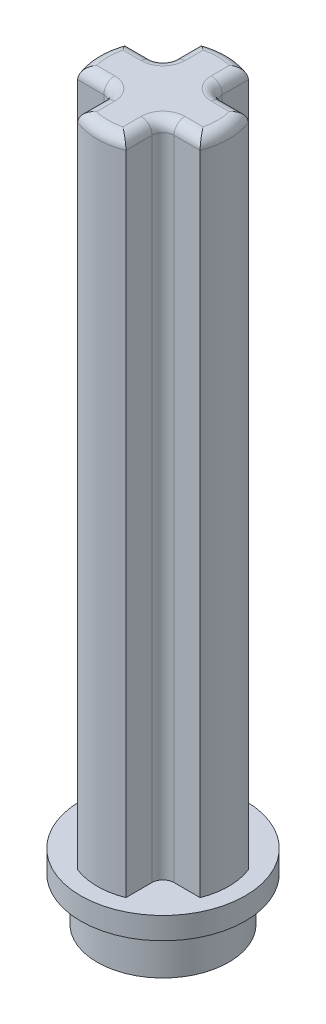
ISO-10303-21;
HEADER;
FILE_DESCRIPTION(('STEP AP214'),'2;1');
FILE_NAME('part.step','',(''),(''),'','','');
FILE_SCHEMA(('AUTOMOTIVE_DESIGN { 1 0 10303 214 1 1 1 1 }'));
ENDSEC;
DATA;
#1=APPLICATION_CONTEXT('core data for automotive mechanical design processes');
#2=APPLICATION_PROTOCOL_DEFINITION('international standard','automotive_design',2000,#1);
#3=PRODUCT_CONTEXT('',#1,'mechanical');
#4=PRODUCT('Part','Part','',(#3));
#5=PRODUCT_RELATED_PRODUCT_CATEGORY('part','',(#4));
#6=PRODUCT_DEFINITION_FORMATION('','',#4);
#7=PRODUCT_DEFINITION_CONTEXT('part definition',#1,'design');
#8=PRODUCT_DEFINITION('design','',#6,#7);
#9=PRODUCT_DEFINITION_SHAPE('','',#8);
#10=(LENGTH_UNIT() NAMED_UNIT(*) SI_UNIT(.MILLI.,.METRE.));
#11=(NAMED_UNIT(*) PLANE_ANGLE_UNIT() SI_UNIT($,.RADIAN.));
#12=(NAMED_UNIT(*) SI_UNIT($,.STERADIAN.) SOLID_ANGLE_UNIT());
#13=UNCERTAINTY_MEASURE_WITH_UNIT(LENGTH_MEASURE(1.E-05),#10,'distance_accuracy_value','');
#14=(GEOMETRIC_REPRESENTATION_CONTEXT(3) GLOBAL_UNCERTAINTY_ASSIGNED_CONTEXT((#13)) GLOBAL_UNIT_ASSIGNED_CONTEXT((#10,
#11,#12)) REPRESENTATION_CONTEXT('',''));
#15=CARTESIAN_POINT('',(0.,0.,0.));
#16=DIRECTION('',(0.,0.,1.));
#17=DIRECTION('',(1.,0.,0.));
#18=AXIS2_PLACEMENT_3D('',#15,#16,#17);
#19=CARTESIAN_POINT('',(0.,-0.8,0.));
#20=DIRECTION('',(0.,-1.,0.));
#21=DIRECTION('',(0.,0.,-1.));
#22=AXIS2_PLACEMENT_3D('',#19,#20,#21);
#23=PLANE('',#22);
#24=CARTESIAN_POINT('',(0.,-0.8,0.));
#25=DIRECTION('',(0.,1.,0.));
#26=DIRECTION('',(0.,0.,1.));
#27=AXIS2_PLACEMENT_3D('',#24,#25,#26);
#28=CIRCLE('',#27,1.6);
#29=CARTESIAN_POINT('',(0.,-0.8,1.6));
#30=VERTEX_POINT('',#29);
#31=EDGE_CURVE('E518',#30,#30,#28,.F.);
#32=ORIENTED_EDGE('',*,*,#31,.T.);
#33=EDGE_LOOP('',(#32));
#34=FACE_BOUND('',#33,.T.);
#35=ADVANCED_FACE('F16',(#34),#23,.T.);
#36=CARTESIAN_POINT('',(0.,-2.4,0.));
#37=DIRECTION('',(0.,1.,0.));
#38=DIRECTION('',(0.,0.,1.));
#39=AXIS2_PLACEMENT_3D('',#36,#37,#38);
#40=CYLINDRICAL_SURFACE('',#39,1.6);
#41=CARTESIAN_POINT('',(0.,-2.4,0.));
#42=DIRECTION('',(0.,1.,0.));
#43=DIRECTION('',(0.,0.,1.));
#44=AXIS2_PLACEMENT_3D('',#41,#42,#43);
#45=CIRCLE('',#44,1.6);
#46=CARTESIAN_POINT('',(0.,-2.4,1.6));
#47=VERTEX_POINT('',#46);
#48=EDGE_CURVE('E514',#47,#47,#45,.T.);
#49=ORIENTED_EDGE('',*,*,#48,.F.);
#50=EDGE_LOOP('',(#49));
#51=FACE_BOUND('',#50,.T.);
#52=ORIENTED_EDGE('',*,*,#31,.F.);
#53=EDGE_LOOP('',(#52));
#54=FACE_BOUND('',#53,.T.);
#55=ADVANCED_FACE('F881',(#51,#54),#40,.F.);
#56=CARTESIAN_POINT('',(0.880000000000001,24.,-0.88));
#57=DIRECTION('',(-1.,0.,0.));
#58=DIRECTION('',(0.,0.,1.));
#59=AXIS2_PLACEMENT_3D('',#56,#57,#58);
#60=PLANE('',#59);
#61=DIRECTION('',(0.,0.,1.));
#62=VECTOR('',#61,1.);
#63=CARTESIAN_POINT('',(0.880000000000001,23.6,-0.88));
#64=LINE('',#63,#62);
#65=CARTESIAN_POINT('',(0.880000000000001,23.6,-1.28));
#66=VERTEX_POINT('',#65);
#67=CARTESIAN_POINT('',(0.880000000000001,23.6,-2.23284571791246));
#68=VERTEX_POINT('',#67);
#69=EDGE_CURVE('E800',#66,#68,#64,.F.);
#70=ORIENTED_EDGE('',*,*,#69,.F.);
#71=DIRECTION('',(0.,1.,0.));
#72=VECTOR('',#71,1.);
#73=CARTESIAN_POINT('',(0.880000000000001,24.,-1.28));
#74=LINE('',#73,#72);
#75=CARTESIAN_POINT('',(0.880000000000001,0.,-1.28));
#76=VERTEX_POINT('',#75);
#77=EDGE_CURVE('E511',#66,#76,#74,.F.);
#78=ORIENTED_EDGE('',*,*,#77,.T.);
#79=DIRECTION('',(0.,0.,1.));
#80=VECTOR('',#79,1.);
#81=CARTESIAN_POINT('',(0.880000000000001,0.,-0.88));
#82=LINE('',#81,#80);
#83=CARTESIAN_POINT('',(0.880000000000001,0.,-2.23284571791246));
#84=VERTEX_POINT('',#83);
#85=EDGE_CURVE('E521',#84,#76,#82,.T.);
#86=ORIENTED_EDGE('',*,*,#85,.F.);
#87=DIRECTION('',(0.,1.,0.));
#88=VECTOR('',#87,1.);
#89=CARTESIAN_POINT('',(0.880000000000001,24.,-2.23284571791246));
#90=LINE('',#89,#88);
#91=EDGE_CURVE('E517',#68,#84,#90,.F.);
#92=ORIENTED_EDGE('',*,*,#91,.F.);
#93=EDGE_LOOP('',(#70,#78,#86,#92));
#94=FACE_BOUND('',#93,.T.);
#95=ADVANCED_FACE('F817',(#94),#60,.F.);
#96=CARTESIAN_POINT('',(0.,-2.4,0.));
#97=DIRECTION('',(0.,-1.,0.));
#98=DIRECTION('',(0.,0.,-1.));
#99=AXIS2_PLACEMENT_3D('',#96,#97,#98);
#100=PLANE('',#99);
#101=ORIENTED_EDGE('',*,*,#48,.T.);
#102=EDGE_LOOP('',(#101));
#103=FACE_BOUND('',#102,.T.);
#104=CARTESIAN_POINT('',(0.,-2.4,0.));
#105=DIRECTION('',(0.,1.,0.));
#106=DIRECTION('',(0.,0.,1.));
#107=AXIS2_PLACEMENT_3D('',#104,#105,#106);
#108=CIRCLE('',#107,2.4);
#109=CARTESIAN_POINT('',(0.,-2.4,2.4));
#110=VERTEX_POINT('',#109);
#111=EDGE_CURVE('E504',#110,#110,#108,.T.);
#112=ORIENTED_EDGE('',*,*,#111,.F.);
#113=EDGE_LOOP('',(#112));
#114=FACE_BOUND('',#113,.T.);
#115=ADVANCED_FACE('F876',(#103,#114),#100,.T.);
#116=CARTESIAN_POINT('',(0.,24.,0.));
#117=DIRECTION('',(0.,-1.,0.));
#118=DIRECTION('',(0.,0.,-1.));
#119=AXIS2_PLACEMENT_3D('',#116,#117,#118);
#120=CYLINDRICAL_SURFACE('',#119,2.4);
#121=CARTESIAN_POINT('',(0.,0.,0.));
#122=DIRECTION('',(0.,-1.,0.));
#123=DIRECTION('',(0.,0.,-1.));
#124=AXIS2_PLACEMENT_3D('',#121,#122,#123);
#125=CIRCLE('',#124,2.4);
#126=CARTESIAN_POINT('',(-0.88,0.,-2.23284571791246));
#127=VERTEX_POINT('',#126);
#128=EDGE_CURVE('E512',#84,#127,#125,.F.);
#129=ORIENTED_EDGE('',*,*,#128,.T.);
#130=DIRECTION('',(0.,1.,0.));
#131=VECTOR('',#130,1.);
#132=CARTESIAN_POINT('',(-0.88,24.,-2.23284571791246));
#133=LINE('',#132,#131);
#134=CARTESIAN_POINT('',(-0.88,23.6,-2.23284571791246));
#135=VERTEX_POINT('',#134);
#136=EDGE_CURVE('E782',#127,#135,#133,.T.);
#137=ORIENTED_EDGE('',*,*,#136,.T.);
#138=CARTESIAN_POINT('',(0.,23.6,0.));
#139=DIRECTION('',(0.,1.,0.));
#140=DIRECTION('',(0.,0.,1.));
#141=AXIS2_PLACEMENT_3D('',#138,#139,#140);
#142=CIRCLE('',#141,2.4);
#143=EDGE_CURVE('E637',#68,#135,#142,.T.);
#144=ORIENTED_EDGE('',*,*,#143,.F.);
#145=ORIENTED_EDGE('',*,*,#91,.T.);
#146=EDGE_LOOP('',(#129,#137,#144,#145));
#147=FACE_BOUND('',#146,.T.);
#148=ADVANCED_FACE('F815',(#147),#120,.T.);
#149=CARTESIAN_POINT('',(1.28,24.,-1.28));
#150=DIRECTION('',(0.,1.,0.));
#151=DIRECTION('',(0.,0.,1.));
#152=AXIS2_PLACEMENT_3D('',#149,#150,#151);
#153=CYLINDRICAL_SURFACE('',#152,0.4);
#154=ORIENTED_EDGE('',*,*,#77,.F.);
#155=CARTESIAN_POINT('',(1.28,23.6,-1.28));
#156=DIRECTION('',(0.,1.,0.));
#157=DIRECTION('',(0.,0.,1.));
#158=AXIS2_PLACEMENT_3D('',#155,#156,#157);
#159=CIRCLE('',#158,0.4);
#160=CARTESIAN_POINT('',(1.28,23.6,-0.88));
#161=VERTEX_POINT('',#160);
#162=EDGE_CURVE('E673',#161,#66,#159,.F.);
#163=ORIENTED_EDGE('',*,*,#162,.F.);
#164=DIRECTION('',(0.,1.,0.));
#165=VECTOR('',#164,1.);
#166=CARTESIAN_POINT('',(1.28,24.,-0.88));
#167=LINE('',#166,#165);
#168=CARTESIAN_POINT('',(1.28,0.,-0.88));
#169=VERTEX_POINT('',#168);
#170=EDGE_CURVE('E757',#161,#169,#167,.F.);
#171=ORIENTED_EDGE('',*,*,#170,.T.);
#172=CARTESIAN_POINT('',(1.28,0.,-1.28));
#173=DIRECTION('',(0.,1.,0.));
#174=DIRECTION('',(0.,0.,1.));
#175=AXIS2_PLACEMENT_3D('',#172,#173,#174);
#176=CIRCLE('',#175,0.4);
#177=EDGE_CURVE('E509',#76,#169,#176,.T.);
#178=ORIENTED_EDGE('',*,*,#177,.F.);
#179=EDGE_LOOP('',(#154,#163,#171,#178));
#180=FACE_BOUND('',#179,.T.);
#181=ADVANCED_FACE('F822',(#180),#153,.F.);
#182=CARTESIAN_POINT('',(1.28,24.,1.28));
#183=DIRECTION('',(0.,1.,0.));
#184=DIRECTION('',(0.,0.,1.));
#185=AXIS2_PLACEMENT_3D('',#182,#183,#184);
#186=CYLINDRICAL_SURFACE('',#185,0.4);
#187=DIRECTION('',(0.,1.,0.));
#188=VECTOR('',#187,1.);
#189=CARTESIAN_POINT('',(1.28,24.,0.880000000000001));
#190=LINE('',#189,#188);
#191=CARTESIAN_POINT('',(1.28,0.,0.880000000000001));
#192=VERTEX_POINT('',#191);
#193=CARTESIAN_POINT('',(1.28,23.6,0.880000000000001));
#194=VERTEX_POINT('',#193);
#195=EDGE_CURVE('E832',#192,#194,#190,.T.);
#196=ORIENTED_EDGE('',*,*,#195,.T.);
#197=CARTESIAN_POINT('',(1.28,23.6,1.28));
#198=DIRECTION('',(0.,1.,0.));
#199=DIRECTION('',(0.,0.,1.));
#200=AXIS2_PLACEMENT_3D('',#197,#198,#199);
#201=CIRCLE('',#200,0.4);
#202=CARTESIAN_POINT('',(0.880000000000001,23.6,1.28));
#203=VERTEX_POINT('',#202);
#204=EDGE_CURVE('E108',#203,#194,#201,.F.);
#205=ORIENTED_EDGE('',*,*,#204,.F.);
#206=DIRECTION('',(0.,1.,0.));
#207=VECTOR('',#206,1.);
#208=CARTESIAN_POINT('',(0.880000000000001,24.,1.28));
#209=LINE('',#208,#207);
#210=CARTESIAN_POINT('',(0.880000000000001,0.,1.28));
#211=VERTEX_POINT('',#210);
#212=EDGE_CURVE('E567',#203,#211,#209,.F.);
#213=ORIENTED_EDGE('',*,*,#212,.T.);
#214=CARTESIAN_POINT('',(1.28,0.,1.28));
#215=DIRECTION('',(0.,1.,0.));
#216=DIRECTION('',(0.,0.,1.));
#217=AXIS2_PLACEMENT_3D('',#214,#215,#216);
#218=CIRCLE('',#217,0.4);
#219=EDGE_CURVE('E507',#192,#211,#218,.T.);
#220=ORIENTED_EDGE('',*,*,#219,.F.);
#221=EDGE_LOOP('',(#196,#205,#213,#220));
#222=FACE_BOUND('',#221,.T.);
#223=ADVANCED_FACE('F863',(#222),#186,.F.);
#224=CARTESIAN_POINT('',(0.,-2.4,0.));
#225=DIRECTION('',(0.,1.,0.));
#226=DIRECTION('',(0.,0.,1.));
#227=AXIS2_PLACEMENT_3D('',#224,#225,#226);
#228=CYLINDRICAL_SURFACE('',#227,2.4);
#229=CARTESIAN_POINT('',(0.,-0.8,0.));
#230=DIRECTION('',(0.,1.,0.));
#231=DIRECTION('',(0.,0.,1.));
#232=AXIS2_PLACEMENT_3D('',#229,#230,#231);
#233=CIRCLE('',#232,2.4);
#234=CARTESIAN_POINT('',(0.,-0.8,2.4));
#235=VERTEX_POINT('',#234);
#236=EDGE_CURVE('E499',#235,#235,#233,.T.);
#237=ORIENTED_EDGE('',*,*,#236,.F.);
#238=EDGE_LOOP('',(#237));
#239=FACE_BOUND('',#238,.T.);
#240=ORIENTED_EDGE('',*,*,#111,.T.);
#241=EDGE_LOOP('',(#240));
#242=FACE_BOUND('',#241,.T.);
#243=ADVANCED_FACE('F865',(#239,#242),#228,.T.);
#244=CARTESIAN_POINT('',(0.,23.6,-0.48));
#245=DIRECTION('',(1.,0.,0.));
#246=DIRECTION('',(0.,0.,-1.));
#247=AXIS2_PLACEMENT_3D('',#244,#245,#246);
#248=CYLINDRICAL_SURFACE('',#247,0.4);
#249=CARTESIAN_POINT('',(1.28,23.6,-0.48));
#250=DIRECTION('',(1.,0.,0.));
#251=DIRECTION('',(0.,0.,1.));
#252=AXIS2_PLACEMENT_3D('',#249,#250,#251);
#253=CIRCLE('',#252,0.4);
#254=CARTESIAN_POINT('',(1.28,24.,-0.48));
#255=VERTEX_POINT('',#254);
#256=EDGE_CURVE('E144',#255,#161,#253,.F.);
#257=ORIENTED_EDGE('',*,*,#256,.F.);
#258=DIRECTION('',(1.,0.,0.));
#259=VECTOR('',#258,1.);
#260=CARTESIAN_POINT('',(0.,24.,-0.48));
#261=LINE('',#260,#259);
#262=CARTESIAN_POINT('',(1.94154577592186,24.,-0.48));
#263=VERTEX_POINT('',#262);
#264=EDGE_CURVE('E311',#263,#255,#261,.F.);
#265=ORIENTED_EDGE('',*,*,#264,.F.);
#266=CARTESIAN_POINT('',(2.23284571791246,23.6,-0.88));
#267=CARTESIAN_POINT('',(2.23284573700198,23.6034696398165,-0.880000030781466));
#268=CARTESIAN_POINT('',(2.23281514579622,23.6069392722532,-0.879954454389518));
#269=CARTESIAN_POINT('',(2.23269276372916,23.613878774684,-0.879772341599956));
#270=CARTESIAN_POINT('',(2.23260090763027,23.6173486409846,-0.879635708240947));
#271=CARTESIAN_POINT('',(2.23235584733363,23.6242862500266,-0.879271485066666));
#272=CARTESIAN_POINT('',(2.2322025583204,23.6277539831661,-0.879043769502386));
#273=CARTESIAN_POINT('',(2.23183454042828,23.6346849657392,-0.878497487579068));
#274=CARTESIAN_POINT('',(2.23161970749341,23.638148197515,-0.878178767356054));
#275=CARTESIAN_POINT('',(2.23112853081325,23.6450678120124,-0.877450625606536));
#276=CARTESIAN_POINT('',(2.23085206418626,23.6485241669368,-0.877041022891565));
#277=CARTESIAN_POINT('',(2.23023757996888,23.6554276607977,-0.876131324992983));
#278=CARTESIAN_POINT('',(2.229899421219,23.6588747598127,-0.875631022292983));
#279=CARTESIAN_POINT('',(2.22916154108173,23.6657573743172,-0.874540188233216));
#280=CARTESIAN_POINT('',(2.22876166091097,23.6691928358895,-0.873949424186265));
#281=CARTESIAN_POINT('',(2.22790035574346,23.6760498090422,-0.872677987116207));
#282=CARTESIAN_POINT('',(2.2274387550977,23.6794712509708,-0.871997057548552));
#283=CARTESIAN_POINT('',(2.22645405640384,23.686297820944,-0.870545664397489));
#284=CARTESIAN_POINT('',(2.22593076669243,23.6897028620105,-0.86977492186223));
#285=CARTESIAN_POINT('',(2.22482276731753,23.6964942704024,-0.868144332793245));
#286=CARTESIAN_POINT('',(2.22423785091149,23.6998805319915,-0.867284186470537));
#287=CARTESIAN_POINT('',(2.22300670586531,23.7066320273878,-0.865475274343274));
#288=CARTESIAN_POINT('',(2.22236025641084,23.7099971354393,-0.864526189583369));
#289=CARTESIAN_POINT('',(2.22100618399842,23.7167039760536,-0.86253993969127));
#290=CARTESIAN_POINT('',(2.22029832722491,23.7200455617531,-0.861502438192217));
#291=CARTESIAN_POINT('',(2.21882160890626,23.726703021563,-0.85933994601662));
#292=CARTESIAN_POINT('',(2.21805250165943,23.7300187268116,-0.858214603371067));
#293=CARTESIAN_POINT('',(2.21645348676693,23.7366220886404,-0.855877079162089));
#294=CARTESIAN_POINT('',(2.21562332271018,23.7399095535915,-0.854664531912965));
#295=CARTESIAN_POINT('',(2.21390241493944,23.7464541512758,-0.852153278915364));
#296=CARTESIAN_POINT('',(2.21301140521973,23.7497110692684,-0.850854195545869));
#297=CARTESIAN_POINT('',(2.21116911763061,23.7561921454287,-0.848170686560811));
#298=CARTESIAN_POINT('',(2.21021756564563,23.7594160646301,-0.846785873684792));
#299=CARTESIAN_POINT('',(2.20726520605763,23.7690604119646,-0.842493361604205));
#300=CARTESIAN_POINT('',(2.20517998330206,23.775402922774,-0.839466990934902));
#301=CARTESIAN_POINT('',(2.20077353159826,23.7879305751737,-0.833084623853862));
#302=CARTESIAN_POINT('',(2.1984499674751,23.7941132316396,-0.829725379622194));
#303=CARTESIAN_POINT('',(2.19357004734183,23.8063041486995,-0.822684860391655));
#304=CARTESIAN_POINT('',(2.19101130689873,23.8123095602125,-0.8190003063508));
#305=CARTESIAN_POINT('',(2.18566498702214,23.8241285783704,-0.811317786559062));
#306=CARTESIAN_POINT('',(2.18287501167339,23.8299389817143,-0.80731656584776));
#307=CARTESIAN_POINT('',(2.17707070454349,23.8413511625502,-0.799009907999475));
#308=CARTESIAN_POINT('',(2.17405399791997,23.8469494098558,-0.794701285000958));
#309=CARTESIAN_POINT('',(2.16780118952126,23.8579209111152,-0.785789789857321));
#310=CARTESIAN_POINT('',(2.16456276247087,23.8632903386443,-0.781183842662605));
#311=CARTESIAN_POINT('',(2.15787246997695,23.8737881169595,-0.771687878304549));
#312=CARTESIAN_POINT('',(2.15441836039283,23.8789123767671,-0.766794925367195));
#313=CARTESIAN_POINT('',(2.1473016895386,23.8889051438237,-0.756737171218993));
#314=CARTESIAN_POINT('',(2.14363696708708,23.8937693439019,-0.751569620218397));
#315=CARTESIAN_POINT('',(2.13693730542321,23.902186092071,-0.742134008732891));
#316=CARTESIAN_POINT('',(2.13392969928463,23.9058011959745,-0.737902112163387));
#317=CARTESIAN_POINT('',(2.1277624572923,23.9128972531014,-0.729231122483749));
#318=CARTESIAN_POINT('',(2.12460093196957,23.9163734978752,-0.724789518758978));
#319=CARTESIAN_POINT('',(2.11812354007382,23.9231793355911,-0.715705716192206));
#320=CARTESIAN_POINT('',(2.11480581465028,23.9265041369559,-0.711061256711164));
#321=CARTESIAN_POINT('',(2.1080153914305,23.9329939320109,-0.701577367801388));
#322=CARTESIAN_POINT('',(2.10454089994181,23.9361540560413,-0.696735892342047));
#323=CARTESIAN_POINT('',(2.0974366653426,23.9423013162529,-0.686864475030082));
#324=CARTESIAN_POINT('',(2.09380519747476,23.9452835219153,-0.681832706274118));
#325=CARTESIAN_POINT('',(2.08638751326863,23.9510616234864,-0.671587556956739));
#326=CARTESIAN_POINT('',(2.08259965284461,23.9538525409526,-0.666372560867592));
#327=CARTESIAN_POINT('',(2.07487041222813,23.9592346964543,-0.655768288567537));
#328=CARTESIAN_POINT('',(2.07092747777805,23.9618209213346,-0.6503776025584));
#329=CARTESIAN_POINT('',(2.06289012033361,23.9667803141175,-0.639429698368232));
#330=CARTESIAN_POINT('',(2.0587942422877,23.9691484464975,-0.633871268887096));
#331=CARTESIAN_POINT('',(2.05045386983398,23.9736583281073,-0.622596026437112));
#332=CARTESIAN_POINT('',(2.04620802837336,23.9757950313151,-0.616878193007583));
#333=CARTESIAN_POINT('',(2.03757148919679,23.9798288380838,-0.605292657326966));
#334=CARTESIAN_POINT('',(2.03317956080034,23.9817208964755,-0.599424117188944));
#335=CARTESIAN_POINT('',(2.02425553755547,23.9852523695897,-0.587546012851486));
#336=CARTESIAN_POINT('',(2.01972233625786,23.9868867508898,-0.581535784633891));
#337=CARTESIAN_POINT('',(2.01052142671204,23.9898900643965,-0.569383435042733));
#338=CARTESIAN_POINT('',(2.00585274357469,23.9912539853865,-0.563240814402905));
#339=CARTESIAN_POINT('',(1.99638753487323,23.993703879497,-0.550833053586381));
#340=CARTESIAN_POINT('',(1.99159017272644,23.9947848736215,-0.544567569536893));
#341=CARTESIAN_POINT('',(1.98187531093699,23.9966567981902,-0.531923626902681));
#342=CARTESIAN_POINT('',(1.97695711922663,23.9974427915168,-0.525544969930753));
#343=CARTESIAN_POINT('',(1.96700935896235,23.9987130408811,-0.512684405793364));
#344=CARTESIAN_POINT('',(1.96197924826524,23.9991924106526,-0.506202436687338));
#345=CARTESIAN_POINT('',(1.95181753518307,23.9998383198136,-0.493144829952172));
#346=CARTESIAN_POINT('',(1.9466855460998,24.0000000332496,-0.48656925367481));
#347=CARTESIAN_POINT('',(1.94154577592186,24.,-0.48));
#348=B_SPLINE_CURVE_WITH_KNOTS('',3,(#266,#267,#268,#269,#270,#271,#272,#273,#274,#275,#276,
#277,#278,#279,#280,#281,#282,#283,#284,#285,#286,#287,#288,#289,#290,#291,#292,#293,#294,#295,
#296,#297,#298,#299,#300,#301,#302,#303,#304,#305,#306,#307,#308,#309,#310,#311,#312,#313,#314,
#315,#316,#317,#318,#319,#320,#321,#322,#323,#324,#325,#326,#327,#328,#329,#330,#331,#332,#333,
#334,#335,#336,#337,#338,#339,#340,#341,#342,#343,#344,#345,#346,#347),.UNSPECIFIED.,.F.,.F.,(4,
2,2,2,2,2,2,2,2,2,2,2,2,2,2,2,2,2,2,2,2,2,2,2,2,2,2,2,2,2,2,2,2,2,2,2,2,2,2,2,4),(0.,
0.0104084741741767,0.0208280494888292,0.0312620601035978,0.0417138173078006,0.0521866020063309,
0.0626836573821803,0.0732081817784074,0.0837633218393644,0.0943521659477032,0.104977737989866,
0.115642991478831,0.126350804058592,0.137103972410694,0.147905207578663,0.158757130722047,
0.169662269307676,0.191639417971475,0.213857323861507,0.236332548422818,0.259079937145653,
0.282112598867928,0.305441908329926,0.329077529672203,0.353027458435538,0.372001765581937,
0.391393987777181,0.41120521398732,0.431435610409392,0.452084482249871,0.473150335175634,
0.494630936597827,0.516523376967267,0.538824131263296,0.561529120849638,0.584633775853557,
0.608133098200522,0.632021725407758,0.656293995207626,0.680944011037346,0.705965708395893),.UNSPECIFIED.);
#349=CARTESIAN_POINT('',(2.23284571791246,23.6,-0.88));
#350=VERTEX_POINT('',#349);
#351=EDGE_CURVE('E152',#350,#263,#348,.T.);
#352=ORIENTED_EDGE('',*,*,#351,.F.);
#353=DIRECTION('',(1.,0.,0.));
#354=VECTOR('',#353,1.);
#355=CARTESIAN_POINT('',(0.880000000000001,23.6,-0.88));
#356=LINE('',#355,#354);
#357=EDGE_CURVE('E754',#350,#161,#356,.F.);
#358=ORIENTED_EDGE('',*,*,#357,.T.);
#359=EDGE_LOOP('',(#257,#265,#352,#358));
#360=FACE_BOUND('',#359,.T.);
#361=ADVANCED_FACE('F683',(#360),#248,.T.);
#362=CARTESIAN_POINT('',(1.28,23.6,-1.28));
#363=DIRECTION('',(0.,1.,0.));
#364=DIRECTION('',(0.,0.,1.));
#365=AXIS2_PLACEMENT_3D('',#362,#363,#364);
#366=TOROIDAL_SURFACE('',#365,0.8,0.4);
#367=CARTESIAN_POINT('',(0.480000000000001,23.6,-1.28));
#368=DIRECTION('',(0.,0.,1.));
#369=DIRECTION('',(1.,0.,0.));
#370=AXIS2_PLACEMENT_3D('',#367,#368,#369);
#371=CIRCLE('',#370,0.4);
#372=CARTESIAN_POINT('',(0.480000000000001,24.,-1.28));
#373=VERTEX_POINT('',#372);
#374=EDGE_CURVE('E665',#373,#66,#371,.F.);
#375=ORIENTED_EDGE('',*,*,#374,.F.);
#376=CARTESIAN_POINT('',(1.28,24.,-1.28));
#377=DIRECTION('',(0.,1.,0.));
#378=DIRECTION('',(-1.,0.,0.));
#379=AXIS2_PLACEMENT_3D('',#376,#377,#378);
#380=CIRCLE('',#379,0.8);
#381=EDGE_CURVE('E308',#255,#373,#380,.F.);
#382=ORIENTED_EDGE('',*,*,#381,.F.);
#383=ORIENTED_EDGE('',*,*,#256,.T.);
#384=ORIENTED_EDGE('',*,*,#162,.T.);
#385=EDGE_LOOP('',(#375,#382,#383,#384));
#386=FACE_BOUND('',#385,.T.);
#387=ADVANCED_FACE('F679',(#386),#366,.T.);
#388=CARTESIAN_POINT('',(0.480000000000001,23.6,0.));
#389=DIRECTION('',(0.,0.,1.));
#390=DIRECTION('',(1.,0.,0.));
#391=AXIS2_PLACEMENT_3D('',#388,#389,#390);
#392=CYLINDRICAL_SURFACE('',#391,0.4);
#393=CARTESIAN_POINT('',(0.48,24.,-1.94154577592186));
#394=CARTESIAN_POINT('',(0.486567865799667,24.000000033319,-1.9466844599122));
#395=CARTESIAN_POINT('',(0.49314203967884,23.9998383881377,-1.95181538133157));
#396=CARTESIAN_POINT('',(0.506196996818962,23.9991927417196,-1.96197513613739));
#397=CARTESIAN_POINT('',(0.512677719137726,23.9987135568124,-1.96700435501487));
#398=CARTESIAN_POINT('',(0.525535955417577,23.9974437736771,-1.9769505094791));
#399=CARTESIAN_POINT('',(0.531913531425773,23.9966580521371,-1.98186798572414));
#400=CARTESIAN_POINT('',(0.544555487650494,23.9947867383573,-1.99158159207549));
#401=CARTESIAN_POINT('',(0.55082006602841,23.9937060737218,-1.99637841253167));
#402=CARTESIAN_POINT('',(0.563226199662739,23.9912568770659,-2.00584270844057));
#403=CARTESIAN_POINT('',(0.569368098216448,23.9898933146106,-2.01051101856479));
#404=CARTESIAN_POINT('',(0.581519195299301,23.9868907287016,-2.01971134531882));
#405=CARTESIAN_POINT('',(0.587528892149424,23.9852567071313,-2.02424433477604));
#406=CARTESIAN_POINT('',(0.599406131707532,23.9817259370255,-2.03316808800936));
#407=CARTESIAN_POINT('',(0.605274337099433,23.9798342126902,-2.03755995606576));
#408=CARTESIAN_POINT('',(0.616859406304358,23.9758010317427,-2.0461965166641));
#409=CARTESIAN_POINT('',(0.622577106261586,23.9736646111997,-2.05044243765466));
#410=CARTESIAN_POINT('',(0.633852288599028,23.9691552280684,-2.05878309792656));
#411=CARTESIAN_POINT('',(0.639410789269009,23.966787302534,-2.06287918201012));
#412=CARTESIAN_POINT('',(0.650359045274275,23.9618282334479,-2.07091706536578));
#413=CARTESIAN_POINT('',(0.655750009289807,23.9592421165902,-2.07486031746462));
#414=CARTESIAN_POINT('',(0.666355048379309,23.9538600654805,-2.08259029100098));
#415=CARTESIAN_POINT('',(0.671570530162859,23.9510691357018,-2.08637856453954));
#416=CARTESIAN_POINT('',(0.681816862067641,23.9452908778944,-2.09379715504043));
#417=CARTESIAN_POINT('',(0.686849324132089,23.9423085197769,-2.09742911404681));
#418=CARTESIAN_POINT('',(0.696722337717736,23.9361608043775,-2.10453439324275));
#419=CARTESIAN_POINT('',(0.701564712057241,23.9330003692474,-2.10800943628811));
#420=CARTESIAN_POINT('',(0.711050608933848,23.9265097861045,-2.11480100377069));
#421=CARTESIAN_POINT('',(0.715696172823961,23.9231844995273,-2.11811932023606));
#422=CARTESIAN_POINT('',(0.724782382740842,23.9163775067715,-2.12459792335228));
#423=CARTESIAN_POINT('',(0.729225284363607,23.9129005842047,-2.12776006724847));
#424=CARTESIAN_POINT('',(0.737899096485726,23.9058029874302,-2.13392852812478));
#425=CARTESIAN_POINT('',(0.742132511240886,23.9021870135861,-2.13693673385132));
#426=CARTESIAN_POINT('',(0.751569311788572,23.8937701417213,-2.14363612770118));
#427=CARTESIAN_POINT('',(0.756736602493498,23.8889067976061,-2.1473000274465));
#428=CARTESIAN_POINT('',(0.766793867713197,23.8789157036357,-2.15441527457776));
#429=CARTESIAN_POINT('',(0.771686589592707,23.8737922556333,-2.15786877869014));
#430=CARTESIAN_POINT('',(0.781182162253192,23.863296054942,-2.16455803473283));
#431=CARTESIAN_POINT('',(0.78578794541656,23.8579273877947,-2.16779602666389));
#432=CARTESIAN_POINT('',(0.794699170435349,23.8469573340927,-2.17404813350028));
#433=CARTESIAN_POINT('',(0.799007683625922,23.8413597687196,-2.17706456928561));
#434=CARTESIAN_POINT('',(0.807314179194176,23.8299488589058,-2.18286848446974));
#435=CARTESIAN_POINT('',(0.811315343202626,23.8241390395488,-2.18565833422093));
#436=CARTESIAN_POINT('',(0.818997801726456,23.8123210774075,-2.19100453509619));
#437=CARTESIAN_POINT('',(0.822682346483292,23.806316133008,-2.19356327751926));
#438=CARTESIAN_POINT('',(0.829722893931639,23.7941260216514,-2.19844331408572));
#439=CARTESIAN_POINT('',(0.833082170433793,23.7879436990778,-2.20076698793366));
#440=CARTESIAN_POINT('',(0.839464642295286,23.7754165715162,-2.20517375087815));
#441=CARTESIAN_POINT('',(0.842491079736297,23.7690742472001,-2.20725917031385));
#442=CARTESIAN_POINT('',(0.846783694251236,23.7594301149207,-2.21021186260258));
#443=CARTESIAN_POINT('',(0.848168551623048,23.7562062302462,-2.21116353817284));
#444=CARTESIAN_POINT('',(0.850852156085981,23.7497251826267,-2.21300608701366));
#445=CARTESIAN_POINT('',(0.852151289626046,23.7464682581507,-2.21389723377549));
#446=CARTESIAN_POINT('',(0.854662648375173,23.7399236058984,-2.21561842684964));
#447=CARTESIAN_POINT('',(0.855875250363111,23.7366360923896,-2.21644873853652));
#448=CARTESIAN_POINT('',(0.858212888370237,23.7300325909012,-2.2180480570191));
#449=CARTESIAN_POINT('',(0.85933828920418,23.7267167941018,-2.21881731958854));
#450=CARTESIAN_POINT('',(0.861500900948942,23.7200591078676,-2.22029435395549));
#451=CARTESIAN_POINT('',(0.862538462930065,23.7167173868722,-2.22100237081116));
#452=CARTESIAN_POINT('',(0.864524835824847,23.7100102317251,-2.22235676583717));
#453=CARTESIAN_POINT('',(0.865473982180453,23.7066449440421,-2.22300337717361));
#454=CARTESIAN_POINT('',(0.867283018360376,23.6998930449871,-2.22423484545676));
#455=CARTESIAN_POINT('',(0.868143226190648,23.6965065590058,-2.2248199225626));
#456=CARTESIAN_POINT('',(0.869773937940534,23.6897146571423,-2.22592823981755));
#457=CARTESIAN_POINT('',(0.870544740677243,23.6863093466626,-2.22645168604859));
#458=CARTESIAN_POINT('',(0.871996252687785,23.6794821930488,-2.22743669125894));
#459=CARTESIAN_POINT('',(0.872677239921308,23.6760604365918,-2.22789844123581));
#460=CARTESIAN_POINT('',(0.873948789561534,23.6692027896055,-2.22876003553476));
#461=CARTESIAN_POINT('',(0.874539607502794,23.6657669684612,-2.22916005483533));
#462=CARTESIAN_POINT('',(0.87563054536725,23.6588835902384,-2.22989820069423));
#463=CARTESIAN_POINT('',(0.876130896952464,23.6554360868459,-2.23023648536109));
#464=CARTESIAN_POINT('',(0.87704068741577,23.6485317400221,-2.23085120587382));
#465=CARTESIAN_POINT('',(0.877450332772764,23.6450749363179,-2.2311277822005));
#466=CARTESIAN_POINT('',(0.87817855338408,23.6381543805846,-2.2316191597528));
#467=CARTESIAN_POINT('',(0.878497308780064,23.634690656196,-2.23183408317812));
#468=CARTESIAN_POINT('',(0.879043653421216,23.6277586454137,-2.23220226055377));
#469=CARTESIAN_POINT('',(0.879271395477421,23.6242903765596,-2.23235561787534));
#470=CARTESIAN_POINT('',(0.879635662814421,23.6173516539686,-2.23260079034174));
#471=CARTESIAN_POINT('',(0.879772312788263,23.6138812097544,-2.2326926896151));
#472=CARTESIAN_POINT('',(0.879954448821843,23.6069405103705,-2.23281513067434));
#473=CARTESIAN_POINT('',(0.880000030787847,23.6034702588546,-2.23284573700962));
#474=CARTESIAN_POINT('',(0.88,23.6,-2.23284571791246));
#475=B_SPLINE_CURVE_WITH_KNOTS('',3,(#393,#394,#395,#396,#397,#398,#399,#400,#401,#402,#403,
#404,#405,#406,#407,#408,#409,#410,#411,#412,#413,#414,#415,#416,#417,#418,#419,#420,#421,#422,
#423,#424,#425,#426,#427,#428,#429,#430,#431,#432,#433,#434,#435,#436,#437,#438,#439,#440,#441,
#442,#443,#444,#445,#446,#447,#448,#449,#450,#451,#452,#453,#454,#455,#456,#457,#458,#459,#460,
#461,#462,#463,#464,#465,#466,#467,#468,#469,#470,#471,#472,#473,#474),.UNSPECIFIED.,.F.,.F.,(4,
2,2,2,2,2,2,2,2,2,2,2,2,2,2,2,2,2,2,2,2,2,2,2,2,2,2,2,2,2,2,2,2,2,2,2,2,2,2,2,4),(0.,
0.0250164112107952,0.0496618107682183,0.0739301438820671,0.0978155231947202,0.121312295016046,
0.144415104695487,0.167118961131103,0.189419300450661,0.211312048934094,0.232793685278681,
0.253861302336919,0.274512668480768,0.294746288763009,0.314561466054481,0.333958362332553,
0.35293806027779,0.376884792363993,0.400517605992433,0.423844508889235,0.446875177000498,
0.469620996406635,0.492095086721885,0.514312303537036,0.536289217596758,0.547194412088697,
0.558046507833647,0.568848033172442,0.579601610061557,0.59030995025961,0.600975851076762,
0.611602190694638,0.622191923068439,0.63274807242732,0.643273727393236,0.653772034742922,
0.664246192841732,0.674699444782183,0.685135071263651,0.695556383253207,0.70596671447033),.UNSPECIFIED.);
#476=CARTESIAN_POINT('',(0.48,24.,-1.94154577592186));
#477=VERTEX_POINT('',#476);
#478=EDGE_CURVE('E644',#477,#68,#475,.T.);
#479=ORIENTED_EDGE('',*,*,#478,.F.);
#480=DIRECTION('',(0.,0.,1.));
#481=VECTOR('',#480,1.);
#482=CARTESIAN_POINT('',(0.480000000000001,24.,0.));
#483=LINE('',#482,#481);
#484=EDGE_CURVE('E305',#373,#477,#483,.F.);
#485=ORIENTED_EDGE('',*,*,#484,.F.);
#486=ORIENTED_EDGE('',*,*,#374,.T.);
#487=ORIENTED_EDGE('',*,*,#69,.T.);
#488=EDGE_LOOP('',(#479,#485,#486,#487));
#489=FACE_BOUND('',#488,.T.);
#490=ADVANCED_FACE('F622',(#489),#392,.T.);
#491=CARTESIAN_POINT('',(0.,23.6,0.));
#492=DIRECTION('',(0.,1.,0.));
#493=DIRECTION('',(0.,0.,1.));
#494=AXIS2_PLACEMENT_3D('',#491,#492,#493);
#495=TOROIDAL_SURFACE('',#494,2.,0.4);
#496=CARTESIAN_POINT('',(-0.879999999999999,23.6,-2.23284571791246));
#497=CARTESIAN_POINT('',(-0.880000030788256,23.603469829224,-2.23284573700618));
#498=CARTESIAN_POINT('',(-0.87995444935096,23.6069396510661,-2.23281514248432));
#499=CARTESIAN_POINT('',(-0.879772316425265,23.6138795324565,-2.23269274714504));
#500=CARTESIAN_POINT('',(-0.879635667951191,23.6173495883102,-2.23260088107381));
#501=CARTESIAN_POINT('',(-0.879271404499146,23.6242875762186,-2.23235579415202));
#502=CARTESIAN_POINT('',(-0.879043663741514,23.6277554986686,-2.23220248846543));
#503=CARTESIAN_POINT('',(-0.878497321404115,23.6346868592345,-2.23183443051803));
#504=CARTESIAN_POINT('',(-0.878178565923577,23.6381502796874,-2.23161957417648));
#505=CARTESIAN_POINT('',(-0.877450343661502,23.6450702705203,-2.23112834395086));
#506=CARTESIAN_POINT('',(-0.877040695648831,23.648526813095,-2.23085184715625));
#507=CARTESIAN_POINT('',(-0.876130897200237,23.6554306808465,-2.23023729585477));
#508=CARTESIAN_POINT('',(-0.875630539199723,23.6588779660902,-2.22989910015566));
#509=CARTESIAN_POINT('',(-0.874539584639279,23.6657609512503,-2.22916113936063));
#510=CARTESIAN_POINT('',(-0.873948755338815,23.6691965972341,-2.2287612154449));
#511=CARTESIAN_POINT('',(-0.872677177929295,23.6760539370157,-2.22789981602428));
#512=CARTESIAN_POINT('',(-0.871996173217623,23.6794755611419,-2.22743816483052));
#513=CARTESIAN_POINT('',(-0.870544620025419,23.6863024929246,-2.2264533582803));
#514=CARTESIAN_POINT('',(-0.869773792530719,23.6897077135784,-2.22593001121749));
#515=CARTESIAN_POINT('',(-0.86814302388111,23.6964994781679,-2.22482189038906));
#516=CARTESIAN_POINT('',(-0.867282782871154,23.6998859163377,-2.224236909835));
#517=CARTESIAN_POINT('',(-0.865473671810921,23.7066377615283,-2.2230056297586));
#518=CARTESIAN_POINT('',(-0.864524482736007,23.7100030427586,-2.22235910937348));
#519=CARTESIAN_POINT('',(-0.862538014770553,23.7167102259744,-2.2210048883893));
#520=CARTESIAN_POINT('',(-0.861500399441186,23.7200519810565,-2.22029695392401));
#521=CARTESIAN_POINT('',(-0.859337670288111,23.7267097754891,-2.21882007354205));
#522=CARTESIAN_POINT('',(-0.858212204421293,23.730025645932,-2.21805088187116));
#523=CARTESIAN_POINT('',(-0.855874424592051,23.7366293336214,-2.21645169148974));
#524=CARTESIAN_POINT('',(-0.854661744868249,23.7399169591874,-2.21562143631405));
#525=CARTESIAN_POINT('',(-0.852150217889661,23.7464618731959,-2.21390033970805));
#526=CARTESIAN_POINT('',(-0.850850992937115,23.7497189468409,-2.21300923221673));
#527=CARTESIAN_POINT('',(-0.848167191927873,23.7562003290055,-2.21116674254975));
#528=CARTESIAN_POINT('',(-0.846782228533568,23.7594243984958,-2.21021508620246));
#529=CARTESIAN_POINT('',(-0.842489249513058,23.7690691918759,-2.20726240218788));
#530=CARTESIAN_POINT('',(-0.839462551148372,23.7754119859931,-2.20517695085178));
#531=CARTESIAN_POINT('',(-0.833079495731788,23.787940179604,-2.20077001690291));
#532=CARTESIAN_POINT('',(-0.829719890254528,23.7941230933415,-2.19844619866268));
#533=CARTESIAN_POINT('',(-0.822678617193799,23.8063144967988,-2.1935657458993));
#534=CARTESIAN_POINT('',(-0.8189936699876,23.8123201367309,-2.1910067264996));
#535=CARTESIAN_POINT('',(-0.811310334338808,23.8241395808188,-2.18565982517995));
#536=CARTESIAN_POINT('',(-0.807308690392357,23.8299501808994,-2.18286954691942));
#537=CARTESIAN_POINT('',(-0.799001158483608,23.8413627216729,-2.17706461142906));
#538=CARTESIAN_POINT('',(-0.794692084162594,23.846961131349,-2.17404757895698));
#539=CARTESIAN_POINT('',(-0.785779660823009,23.8579329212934,-2.16779409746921));
#540=CARTESIAN_POINT('',(-0.781173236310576,23.8633024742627,-2.16455532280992));
#541=CARTESIAN_POINT('',(-0.771676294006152,23.8738004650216,-2.15786431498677));
#542=CARTESIAN_POINT('',(-0.766782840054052,23.8789248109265,-2.15440983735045));
#543=CARTESIAN_POINT('',(-0.756724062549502,23.8889177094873,-2.14729241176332));
#544=CARTESIAN_POINT('',(-0.751555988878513,23.8937819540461,-2.14362730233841));
#545=CARTESIAN_POINT('',(-0.742119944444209,23.9021982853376,-2.13692730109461));
#546=CARTESIAN_POINT('',(-0.737888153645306,23.9058129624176,-2.13391975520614));
#547=CARTESIAN_POINT('',(-0.7292174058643,23.9129081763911,-2.12775265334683));
#548=CARTESIAN_POINT('',(-0.724775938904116,23.9163840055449,-2.12459120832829));
#549=CARTESIAN_POINT('',(-0.715692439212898,23.9231890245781,-2.11811399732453));
#550=CARTESIAN_POINT('',(-0.711048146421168,23.9265134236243,-2.11479637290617));
#551=CARTESIAN_POINT('',(-0.701564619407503,23.9330024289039,-2.10800617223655));
#552=CARTESIAN_POINT('',(-0.696723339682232,23.9361621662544,-2.10453180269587));
#553=CARTESIAN_POINT('',(-0.686852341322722,23.9423086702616,-2.09742783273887));
#554=CARTESIAN_POINT('',(-0.681820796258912,23.9452905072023,-2.09379650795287));
#555=CARTESIAN_POINT('',(-0.671576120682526,23.9510678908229,-2.08637913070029));
#556=CARTESIAN_POINT('',(-0.666361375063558,23.9538584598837,-2.08259143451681));
#557=CARTESIAN_POINT('',(-0.655757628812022,23.9592399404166,-2.07486254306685));
#558=CARTESIAN_POINT('',(-0.650367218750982,23.9618258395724,-2.07091979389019));
#559=CARTESIAN_POINT('',(-0.639419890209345,23.9667846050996,-2.06288282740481));
#560=CARTESIAN_POINT('',(-0.633861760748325,23.9691524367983,-2.05878715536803));
#561=CARTESIAN_POINT('',(-0.622587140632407,23.9736617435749,-2.0504472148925));
#562=CARTESIAN_POINT('',(-0.616869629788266,23.9757981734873,-2.04620159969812));
#563=CARTESIAN_POINT('',(-0.605284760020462,23.9798314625,-2.03756553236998));
#564=CARTESIAN_POINT('',(-0.599416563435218,23.98172327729,-2.03317384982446));
#565=CARTESIAN_POINT('',(-0.587539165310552,23.9852542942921,-2.02425033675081));
#566=CARTESIAN_POINT('',(-0.581529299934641,23.9868884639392,-2.01971740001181));
#567=CARTESIAN_POINT('',(-0.569377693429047,23.9898913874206,-2.01051703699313));
#568=CARTESIAN_POINT('',(-0.563235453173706,23.9912551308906,-2.00584863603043));
#569=CARTESIAN_POINT('',(-0.550828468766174,23.9937047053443,-1.99638400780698));
#570=CARTESIAN_POINT('',(-0.544563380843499,23.9947855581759,-1.99158694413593));
#571=CARTESIAN_POINT('',(-0.531920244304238,23.9966572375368,-1.9818726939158));
#572=CARTESIAN_POINT('',(-0.525541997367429,23.9974431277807,-1.97695481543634));
#573=CARTESIAN_POINT('',(-0.512682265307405,23.9987132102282,-1.96700769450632));
#574=CARTESIAN_POINT('',(-0.506200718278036,23.9991925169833,-1.96197791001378));
#575=CARTESIAN_POINT('',(-0.493143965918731,23.9998383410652,-1.95181686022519));
#576=CARTESIAN_POINT('',(-0.486568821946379,24.0000000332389,-1.94668520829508));
#577=CARTESIAN_POINT('',(-0.48,24.,-1.94154577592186));
#578=B_SPLINE_CURVE_WITH_KNOTS('',3,(#496,#497,#498,#499,#500,#501,#502,#503,#504,#505,#506,
#507,#508,#509,#510,#511,#512,#513,#514,#515,#516,#517,#518,#519,#520,#521,#522,#523,#524,#525,
#526,#527,#528,#529,#530,#531,#532,#533,#534,#535,#536,#537,#538,#539,#540,#541,#542,#543,#544,
#545,#546,#547,#548,#549,#550,#551,#552,#553,#554,#555,#556,#557,#558,#559,#560,#561,#562,#563,
#564,#565,#566,#567,#568,#569,#570,#571,#572,#573,#574,#575,#576,#577),.UNSPECIFIED.,.F.,.F.,(4,
2,2,2,2,2,2,2,2,2,2,2,2,2,2,2,2,2,2,2,2,2,2,2,2,2,2,2,2,2,2,2,2,2,2,2,2,2,2,2,4),(0.,
0.0104090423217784,0.0208291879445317,0.0312637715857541,0.04171610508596,0.052189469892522,
0.0626871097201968,0.0732122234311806,0.0837679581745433,0.0943574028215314,0.104983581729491,
0.115649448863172,0.126357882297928,0.137111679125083,0.147913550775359,0.158766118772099,
0.169671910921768,0.191650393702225,0.21386967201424,0.23634630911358,0.259095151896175,
0.282129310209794,0.305460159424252,0.329097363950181,0.353048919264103,0.372022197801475,
0.391413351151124,0.411223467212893,0.431452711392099,0.452100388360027,0.473165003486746,
0.494644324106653,0.516535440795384,0.538834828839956,0.561538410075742,0.584641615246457,
0.608139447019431,0.632026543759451,0.65629724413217,0.68094565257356,0.705965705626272),.UNSPECIFIED.);
#579=CARTESIAN_POINT('',(-0.48,24.,-1.94154577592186));
#580=VERTEX_POINT('',#579);
#581=EDGE_CURVE('E596',#580,#135,#578,.F.);
#582=ORIENTED_EDGE('',*,*,#581,.F.);
#583=CARTESIAN_POINT('',(0.,24.,0.));
#584=DIRECTION('',(0.,-1.,0.));
#585=DIRECTION('',(-0.239999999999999,0.,-0.970772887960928));
#586=AXIS2_PLACEMENT_3D('',#583,#584,#585);
#587=CIRCLE('',#586,2.);
#588=EDGE_CURVE('E302',#477,#580,#587,.F.);
#589=ORIENTED_EDGE('',*,*,#588,.F.);
#590=ORIENTED_EDGE('',*,*,#478,.T.);
#591=ORIENTED_EDGE('',*,*,#143,.T.);
#592=EDGE_LOOP('',(#582,#589,#590,#591));
#593=FACE_BOUND('',#592,.T.);
#594=ADVANCED_FACE('F615',(#593),#495,.T.);
#595=CARTESIAN_POINT('',(-0.48,23.6,0.));
#596=DIRECTION('',(0.,0.,-1.));
#597=DIRECTION('',(-1.,0.,0.));
#598=AXIS2_PLACEMENT_3D('',#595,#596,#597);
#599=CYLINDRICAL_SURFACE('',#598,0.4);
#600=ORIENTED_EDGE('',*,*,#581,.T.);
#601=DIRECTION('',(0.,0.,-1.));
#602=VECTOR('',#601,1.);
#603=CARTESIAN_POINT('',(-0.88,23.6,-2.23284571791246));
#604=LINE('',#603,#602);
#605=CARTESIAN_POINT('',(-0.88,23.6,-1.28));
#606=VERTEX_POINT('',#605);
#607=EDGE_CURVE('E785',#135,#606,#604,.F.);
#608=ORIENTED_EDGE('',*,*,#607,.T.);
#609=CARTESIAN_POINT('',(-0.48,23.6,-1.28));
#610=DIRECTION('',(0.,0.,-1.));
#611=DIRECTION('',(1.,0.,0.));
#612=AXIS2_PLACEMENT_3D('',#609,#610,#611);
#613=CIRCLE('',#612,0.4);
#614=CARTESIAN_POINT('',(-0.48,24.,-1.28));
#615=VERTEX_POINT('',#614);
#616=EDGE_CURVE('E564',#615,#606,#613,.F.);
#617=ORIENTED_EDGE('',*,*,#616,.F.);
#618=DIRECTION('',(0.,0.,1.));
#619=VECTOR('',#618,1.);
#620=CARTESIAN_POINT('',(-0.48,24.,0.));
#621=LINE('',#620,#619);
#622=EDGE_CURVE('E299',#580,#615,#621,.T.);
#623=ORIENTED_EDGE('',*,*,#622,.F.);
#624=EDGE_LOOP('',(#600,#608,#617,#623));
#625=FACE_BOUND('',#624,.T.);
#626=ADVANCED_FACE('F604',(#625),#599,.T.);
#627=CARTESIAN_POINT('',(-1.28,23.6,1.28));
#628=DIRECTION('',(0.,1.,0.));
#629=DIRECTION('',(0.,0.,1.));
#630=AXIS2_PLACEMENT_3D('',#627,#628,#629);
#631=TOROIDAL_SURFACE('',#630,0.8,0.4);
#632=CARTESIAN_POINT('',(-1.28,23.6,0.480000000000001));
#633=DIRECTION('',(-1.,0.,0.));
#634=DIRECTION('',(0.,0.,1.));
#635=AXIS2_PLACEMENT_3D('',#632,#633,#634);
#636=CIRCLE('',#635,0.4);
#637=CARTESIAN_POINT('',(-1.28,23.6,0.880000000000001));
#638=VERTEX_POINT('',#637);
#639=CARTESIAN_POINT('',(-1.28,24.,0.480000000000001));
#640=VERTEX_POINT('',#639);
#641=EDGE_CURVE('E497',#638,#640,#636,.T.);
#642=ORIENTED_EDGE('',*,*,#641,.F.);
#643=CARTESIAN_POINT('',(-1.28,23.6,1.28));
#644=DIRECTION('',(0.,1.,0.));
#645=DIRECTION('',(0.,0.,1.));
#646=AXIS2_PLACEMENT_3D('',#643,#644,#645);
#647=CIRCLE('',#646,0.4);
#648=CARTESIAN_POINT('',(-0.88,23.6,1.28));
#649=VERTEX_POINT('',#648);
#650=EDGE_CURVE('E502',#638,#649,#647,.F.);
#651=ORIENTED_EDGE('',*,*,#650,.T.);
#652=CARTESIAN_POINT('',(-0.48,23.6,1.28));
#653=DIRECTION('',(0.,0.,-1.));
#654=DIRECTION('',(-1.,0.,0.));
#655=AXIS2_PLACEMENT_3D('',#652,#653,#654);
#656=CIRCLE('',#655,0.4);
#657=CARTESIAN_POINT('',(-0.48,24.,1.28));
#658=VERTEX_POINT('',#657);
#659=EDGE_CURVE('E1177',#658,#649,#656,.F.);
#660=ORIENTED_EDGE('',*,*,#659,.F.);
#661=CARTESIAN_POINT('',(-1.28,24.,1.28));
#662=DIRECTION('',(0.,1.,0.));
#663=DIRECTION('',(1.,0.,0.));
#664=AXIS2_PLACEMENT_3D('',#661,#662,#663);
#665=CIRCLE('',#664,0.8);
#666=EDGE_CURVE('E284',#640,#658,#665,.F.);
#667=ORIENTED_EDGE('',*,*,#666,.F.);
#668=EDGE_LOOP('',(#642,#651,#660,#667));
#669=FACE_BOUND('',#668,.T.);
#670=ADVANCED_FACE('F614',(#669),#631,.T.);
#671=CARTESIAN_POINT('',(-0.48,23.6,0.));
#672=DIRECTION('',(0.,0.,-1.));
#673=DIRECTION('',(-1.,0.,0.));
#674=AXIS2_PLACEMENT_3D('',#671,#672,#673);
#675=CYLINDRICAL_SURFACE('',#674,0.4);
#676=ORIENTED_EDGE('',*,*,#659,.T.);
#677=DIRECTION('',(0.,0.,-1.));
#678=VECTOR('',#677,1.);
#679=CARTESIAN_POINT('',(-0.88,23.6,0.880000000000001));
#680=LINE('',#679,#678);
#681=CARTESIAN_POINT('',(-0.88,23.6,2.23284571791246));
#682=VERTEX_POINT('',#681);
#683=EDGE_CURVE('E755',#649,#682,#680,.F.);
#684=ORIENTED_EDGE('',*,*,#683,.T.);
#685=CARTESIAN_POINT('',(-0.48,24.,1.94154577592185));
#686=CARTESIAN_POINT('',(-0.486567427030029,24.0000000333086,1.94668411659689));
#687=CARTESIAN_POINT('',(-0.493141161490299,23.9998384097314,1.95181469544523));
#688=CARTESIAN_POINT('',(-0.506195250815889,23.9991928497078,1.96197377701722));
#689=CARTESIAN_POINT('',(-0.512675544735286,23.9987137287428,1.96700266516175));
#690=CARTESIAN_POINT('',(-0.525532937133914,23.9974441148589,1.97694817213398));
#691=CARTESIAN_POINT('',(-0.531910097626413,23.9966584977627,1.98186533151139));
#692=CARTESIAN_POINT('',(-0.544551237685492,23.9947874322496,1.99157831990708));
#693=CARTESIAN_POINT('',(-0.550815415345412,23.9937069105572,1.99637483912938));
#694=CARTESIAN_POINT('',(-0.563220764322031,23.9912580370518,2.00583854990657));
#695=CARTESIAN_POINT('',(-0.569362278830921,23.9898946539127,2.0105065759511));
#696=CARTESIAN_POINT('',(-0.581512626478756,23.9868924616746,2.01970635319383));
#697=CARTESIAN_POINT('',(-0.587521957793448,23.98525865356,2.0242390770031));
#698=CARTESIAN_POINT('',(-0.599398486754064,23.9817283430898,2.03316231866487));
#699=CARTESIAN_POINT('',(-0.605266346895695,23.979836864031,2.03755394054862));
#700=CARTESIAN_POINT('',(-0.616850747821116,23.9758042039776,2.04619002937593));
#701=CARTESIAN_POINT('',(-0.62256812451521,23.973668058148,2.05043572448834));
#702=CARTESIAN_POINT('',(-0.633842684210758,23.9691592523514,2.0587759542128));
#703=CARTESIAN_POINT('',(-0.639400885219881,23.966791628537,2.06287183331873));
#704=CARTESIAN_POINT('',(-0.65034856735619,23.9618331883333,2.07090932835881));
#705=CARTESIAN_POINT('',(-0.655739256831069,23.959247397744,2.07485239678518));
#706=CARTESIAN_POINT('',(-0.666343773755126,23.9538660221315,2.08258202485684));
#707=CARTESIAN_POINT('',(-0.671559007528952,23.9510754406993,2.08637013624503));
#708=CARTESIAN_POINT('',(-0.681804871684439,23.9452979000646,2.09378842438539));
#709=CARTESIAN_POINT('',(-0.686837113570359,23.9423159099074,2.09742024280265));
#710=CARTESIAN_POINT('',(-0.696709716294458,23.9361689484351,2.10452526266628));
#711=CARTESIAN_POINT('',(-0.701551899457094,23.9330088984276,2.10800018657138));
#712=CARTESIAN_POINT('',(-0.711037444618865,23.926519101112,2.11479153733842));
#713=CARTESIAN_POINT('',(-0.715682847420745,23.9231942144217,2.1181097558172));
#714=CARTESIAN_POINT('',(-0.724768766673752,23.9163880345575,2.1245881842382));
#715=CARTESIAN_POINT('',(-0.729211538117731,23.9129115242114,2.12775025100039));
#716=CARTESIAN_POINT('',(-0.737885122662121,23.9058147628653,2.13391857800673));
#717=CARTESIAN_POINT('',(-0.742118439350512,23.9021992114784,2.13692672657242));
#718=CARTESIAN_POINT('',(-0.751555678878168,23.8937827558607,2.14362645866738));
#719=CARTESIAN_POINT('',(-0.756723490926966,23.8889193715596,2.14729074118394));
#720=CARTESIAN_POINT('',(-0.766781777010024,23.8789281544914,2.15440673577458));
#721=CARTESIAN_POINT('',(-0.771674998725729,23.8738046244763,2.15786060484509));
#722=CARTESIAN_POINT('',(-0.781171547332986,23.8633082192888,2.16455057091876));
#723=CARTESIAN_POINT('',(-0.785777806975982,23.8579394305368,2.1677889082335));
#724=CARTESIAN_POINT('',(-0.794689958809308,23.8469690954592,2.17404168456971));
#725=CARTESIAN_POINT('',(-0.798998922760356,23.8413713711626,2.1770584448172));
#726=CARTESIAN_POINT('',(-0.807306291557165,23.8299601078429,2.18286298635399));
#727=CARTESIAN_POINT('',(-0.811307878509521,23.8241500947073,2.18565313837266));
#728=CARTESIAN_POINT('',(-0.818991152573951,23.8123317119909,2.19099992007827));
#729=CARTESIAN_POINT('',(-0.822676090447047,23.8063265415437,2.19355894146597));
#730=CARTESIAN_POINT('',(-0.829717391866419,23.7941359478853,2.19843951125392));
#731=CARTESIAN_POINT('',(-0.833077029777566,23.7879533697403,2.20076343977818));
#732=CARTESIAN_POINT('',(-0.839460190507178,23.7754257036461,2.20517068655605));
#733=CARTESIAN_POINT('',(-0.842486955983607,23.7690830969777,2.20725633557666));
#734=CARTESIAN_POINT('',(-0.846780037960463,23.7594385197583,2.21020935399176));
#735=CARTESIAN_POINT('',(-0.848165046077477,23.7562144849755,2.21116113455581));
#736=CARTESIAN_POINT('',(-0.850848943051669,23.7497331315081,2.21300388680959));
#737=CARTESIAN_POINT('',(-0.852148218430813,23.7464760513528,2.21389513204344));
#738=CARTESIAN_POINT('',(-0.854659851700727,23.7399310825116,2.21561651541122));
#739=CARTESIAN_POINT('',(-0.855872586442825,23.7366434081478,2.21644691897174));
#740=CARTESIAN_POINT('',(-0.858210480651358,23.730039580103,2.21804641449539));
#741=CARTESIAN_POINT('',(-0.859336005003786,23.7267236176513,2.21881576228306));
#742=CARTESIAN_POINT('',(-0.861498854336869,23.7200655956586,2.22029296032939));
#743=CARTESIAN_POINT('',(-0.862536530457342,23.7167237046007,2.22100105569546));
#744=CARTESIAN_POINT('',(-0.864523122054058,23.7100162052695,2.2223556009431));
#745=CARTESIAN_POINT('',(-0.865472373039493,23.706650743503,2.22300228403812));
#746=CARTESIAN_POINT('',(-0.867281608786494,23.6998984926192,2.22423388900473));
#747=CARTESIAN_POINT('',(-0.868141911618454,23.6965118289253,2.22481903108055));
#748=CARTESIAN_POINT('',(-0.869772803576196,23.689719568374,2.22592747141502));
#749=CARTESIAN_POINT('',(-0.870543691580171,23.6863140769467,2.22645097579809));
#750=CARTESIAN_POINT('',(-0.871995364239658,23.6794865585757,2.22743609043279));
#751=CARTESIAN_POINT('',(-0.872676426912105,23.6760646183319,2.22789789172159));
#752=CARTESIAN_POINT('',(-0.873948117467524,23.6692066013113,2.22875958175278));
#753=CARTESIAN_POINT('',(-0.874539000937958,23.6657705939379,2.2291596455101));
#754=CARTESIAN_POINT('',(-0.875630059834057,23.658886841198,2.22989787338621));
#755=CARTESIAN_POINT('',(-0.87613046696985,23.6554391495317,2.23023619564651));
#756=CARTESIAN_POINT('',(-0.877040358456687,23.6485344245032,2.23085098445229));
#757=CARTESIAN_POINT('',(-0.877450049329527,23.6450774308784,2.23112759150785));
#758=CARTESIAN_POINT('',(-0.878178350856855,23.6381564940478,2.23161902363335));
#759=CARTESIAN_POINT('',(-0.878497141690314,23.6346925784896,2.23183397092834));
#760=CARTESIAN_POINT('',(-0.879043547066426,23.6277601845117,2.23220218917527));
#761=CARTESIAN_POINT('',(-0.879271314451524,23.6242917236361,2.2323555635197));
#762=CARTESIAN_POINT('',(-0.879635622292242,23.6173526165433,2.23260076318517));
#763=CARTESIAN_POINT('',(-0.87977228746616,23.6138819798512,2.23269267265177));
#764=CARTESIAN_POINT('',(-0.879954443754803,23.6069408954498,2.23281512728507));
#765=CARTESIAN_POINT('',(-0.880000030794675,23.6034704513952,2.23284573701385));
#766=CARTESIAN_POINT('',(-0.88,23.6,2.23284571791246));
#767=B_SPLINE_CURVE_WITH_KNOTS('',3,(#685,#686,#687,#688,#689,#690,#691,#692,#693,#694,#695,
#696,#697,#698,#699,#700,#701,#702,#703,#704,#705,#706,#707,#708,#709,#710,#711,#712,#713,#714,
#715,#716,#717,#718,#719,#720,#721,#722,#723,#724,#725,#726,#727,#728,#729,#730,#731,#732,#733,
#734,#735,#736,#737,#738,#739,#740,#741,#742,#743,#744,#745,#746,#747,#748,#749,#750,#751,#752,
#753,#754,#755,#756,#757,#758,#759,#760,#761,#762,#763,#764,#765,#766),.UNSPECIFIED.,.F.,.F.,(4,
2,2,2,2,2,2,2,2,2,2,2,2,2,2,2,2,2,2,2,2,2,2,2,2,2,2,2,2,2,2,2,2,2,2,2,2,2,2,2,4),(0.,
0.0250147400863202,0.0496585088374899,0.0739252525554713,0.0978090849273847,0.121304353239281,
0.144405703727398,0.167108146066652,0.189407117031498,0.211298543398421,0.232778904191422,
0.253845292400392,0.274495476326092,0.294727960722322,0.314542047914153,0.333937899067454,
0.352916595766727,0.376864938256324,0.400499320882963,0.423827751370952,0.446859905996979,
0.469607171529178,0.49208266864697,0.514301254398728,0.536279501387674,0.547185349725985,
0.558038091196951,0.568840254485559,0.579594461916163,0.590303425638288,0.600969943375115,
0.61159689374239,0.622187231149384,0.632743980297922,0.643270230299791,0.653769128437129,
0.664243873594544,0.674697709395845,0.685133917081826,0.695555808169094,0.705966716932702),.UNSPECIFIED.);
#768=CARTESIAN_POINT('',(-0.48,24.,1.94154577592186));
#769=VERTEX_POINT('',#768);
#770=EDGE_CURVE('E551',#769,#682,#767,.T.);
#771=ORIENTED_EDGE('',*,*,#770,.F.);
#772=DIRECTION('',(0.,0.,1.));
#773=VECTOR('',#772,1.);
#774=CARTESIAN_POINT('',(-0.48,24.,0.));
#775=LINE('',#774,#773);
#776=EDGE_CURVE('E283',#658,#769,#775,.T.);
#777=ORIENTED_EDGE('',*,*,#776,.F.);
#778=EDGE_LOOP('',(#676,#684,#771,#777));
#779=FACE_BOUND('',#778,.T.);
#780=ADVANCED_FACE('F983',(#779),#675,.T.);
#781=CARTESIAN_POINT('',(0.480000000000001,23.6,0.));
#782=DIRECTION('',(0.,0.,1.));
#783=DIRECTION('',(1.,0.,0.));
#784=AXIS2_PLACEMENT_3D('',#781,#782,#783);
#785=CYLINDRICAL_SURFACE('',#784,0.4);
#786=CARTESIAN_POINT('',(0.480000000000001,23.6,1.28));
#787=DIRECTION('',(0.,0.,1.));
#788=DIRECTION('',(-1.,0.,0.));
#789=AXIS2_PLACEMENT_3D('',#786,#787,#788);
#790=CIRCLE('',#789,0.4);
#791=CARTESIAN_POINT('',(0.480000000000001,24.,1.28));
#792=VERTEX_POINT('',#791);
#793=EDGE_CURVE('E789',#792,#203,#790,.F.);
#794=ORIENTED_EDGE('',*,*,#793,.F.);
#795=DIRECTION('',(0.,0.,1.));
#796=VECTOR('',#795,1.);
#797=CARTESIAN_POINT('',(0.48,24.,0.));
#798=LINE('',#797,#796);
#799=CARTESIAN_POINT('',(0.48,24.,1.94154577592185));
#800=VERTEX_POINT('',#799);
#801=EDGE_CURVE('E211',#800,#792,#798,.F.);
#802=ORIENTED_EDGE('',*,*,#801,.F.);
#803=CARTESIAN_POINT('',(0.88,23.6,2.23284571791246));
#804=CARTESIAN_POINT('',(0.880000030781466,23.6034696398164,2.23284573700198));
#805=CARTESIAN_POINT('',(0.879954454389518,23.6069392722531,2.23281514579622));
#806=CARTESIAN_POINT('',(0.879772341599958,23.6138787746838,2.23269276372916));
#807=CARTESIAN_POINT('',(0.87963570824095,23.6173486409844,2.23260090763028));
#808=CARTESIAN_POINT('',(0.879271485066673,23.6242862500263,2.23235584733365));
#809=CARTESIAN_POINT('',(0.879043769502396,23.6277539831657,2.23220255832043));
#810=CARTESIAN_POINT('',(0.878497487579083,23.6346849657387,2.23183454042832));
#811=CARTESIAN_POINT('',(0.878178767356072,23.6381481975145,2.23161970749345));
#812=CARTESIAN_POINT('',(0.87745062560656,23.6450678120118,2.23112853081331));
#813=CARTESIAN_POINT('',(0.877041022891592,23.6485241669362,2.23085206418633));
#814=CARTESIAN_POINT('',(0.876131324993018,23.655427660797,2.23023757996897));
#815=CARTESIAN_POINT('',(0.875631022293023,23.6588747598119,2.2298994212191));
#816=CARTESIAN_POINT('',(0.874540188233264,23.6657573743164,2.22916154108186));
#817=CARTESIAN_POINT('',(0.873949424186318,23.6691928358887,2.22876166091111));
#818=CARTESIAN_POINT('',(0.87267798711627,23.6760498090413,2.22790035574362));
#819=CARTESIAN_POINT('',(0.871997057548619,23.6794712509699,2.22743875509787));
#820=CARTESIAN_POINT('',(0.870545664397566,23.686297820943,2.22645405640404));
#821=CARTESIAN_POINT('',(0.869774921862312,23.6897028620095,2.22593076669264));
#822=CARTESIAN_POINT('',(0.868144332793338,23.6964942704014,2.22482276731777));
#823=CARTESIAN_POINT('',(0.867284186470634,23.6998805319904,2.22423785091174));
#824=CARTESIAN_POINT('',(0.865475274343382,23.7066320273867,2.22300670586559));
#825=CARTESIAN_POINT('',(0.864526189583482,23.7099971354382,2.22236025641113));
#826=CARTESIAN_POINT('',(0.862539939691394,23.7167039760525,2.22100618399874));
#827=CARTESIAN_POINT('',(0.861502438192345,23.7200455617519,2.22029832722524));
#828=CARTESIAN_POINT('',(0.859339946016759,23.7267030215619,2.21882160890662));
#829=CARTESIAN_POINT('',(0.858214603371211,23.7300187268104,2.2180525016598));
#830=CARTESIAN_POINT('',(0.855877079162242,23.7366220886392,2.21645348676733));
#831=CARTESIAN_POINT('',(0.854664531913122,23.7399095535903,2.21562332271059));
#832=CARTESIAN_POINT('',(0.85215327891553,23.7464541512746,2.21390241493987));
#833=CARTESIAN_POINT('',(0.850854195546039,23.7497110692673,2.21301140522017));
#834=CARTESIAN_POINT('',(0.84817068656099,23.7561921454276,2.21116911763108));
#835=CARTESIAN_POINT('',(0.846785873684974,23.7594160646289,2.2102175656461));
#836=CARTESIAN_POINT('',(0.842493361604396,23.7690604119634,2.20726520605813));
#837=CARTESIAN_POINT('',(0.839466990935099,23.7754029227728,2.20517998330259));
#838=CARTESIAN_POINT('',(0.833084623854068,23.7879305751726,2.20077353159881));
#839=CARTESIAN_POINT('',(0.829725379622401,23.7941132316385,2.19844996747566));
#840=CARTESIAN_POINT('',(0.822684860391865,23.8063041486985,2.19357004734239));
#841=CARTESIAN_POINT('',(0.81900030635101,23.8123095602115,2.19101130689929));
#842=CARTESIAN_POINT('',(0.811317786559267,23.8241285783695,2.1856649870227));
#843=CARTESIAN_POINT('',(0.80731656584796,23.8299389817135,2.18287501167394));
#844=CARTESIAN_POINT('',(0.799009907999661,23.8413511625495,2.177070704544));
#845=CARTESIAN_POINT('',(0.794701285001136,23.8469494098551,2.17405399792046));
#846=CARTESIAN_POINT('',(0.785789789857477,23.8579209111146,2.16780118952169));
#847=CARTESIAN_POINT('',(0.781183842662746,23.8632903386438,2.16456276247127));
#848=CARTESIAN_POINT('',(0.771687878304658,23.8737881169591,2.15787246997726));
#849=CARTESIAN_POINT('',(0.766794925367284,23.8789123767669,2.15441836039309));
#850=CARTESIAN_POINT('',(0.756737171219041,23.8889051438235,2.14730168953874));
#851=CARTESIAN_POINT('',(0.751569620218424,23.8937693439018,2.14363696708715));
#852=CARTESIAN_POINT('',(0.742134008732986,23.902186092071,2.13693730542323));
#853=CARTESIAN_POINT('',(0.737902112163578,23.9058011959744,2.13392969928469));
#854=CARTESIAN_POINT('',(0.729231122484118,23.9128972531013,2.12776245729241));
#855=CARTESIAN_POINT('',(0.72478951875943,23.916373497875,2.12460093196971));
#856=CARTESIAN_POINT('',(0.715705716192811,23.9231793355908,2.11812354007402));
#857=CARTESIAN_POINT('',(0.711061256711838,23.9265041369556,2.11480581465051));
#858=CARTESIAN_POINT('',(0.701577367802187,23.9329939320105,2.10801539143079));
#859=CARTESIAN_POINT('',(0.696735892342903,23.936154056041,2.10454089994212));
#860=CARTESIAN_POINT('',(0.686864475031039,23.9423013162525,2.09743666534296));
#861=CARTESIAN_POINT('',(0.681832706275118,23.9452835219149,2.09380519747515));
#862=CARTESIAN_POINT('',(0.671587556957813,23.951061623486,2.08638751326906));
#863=CARTESIAN_POINT('',(0.666372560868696,23.9538525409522,2.08259965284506));
#864=CARTESIAN_POINT('',(0.655768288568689,23.9592346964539,2.07487041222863));
#865=CARTESIAN_POINT('',(0.65037760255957,23.9618209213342,2.07092747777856));
#866=CARTESIAN_POINT('',(0.639429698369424,23.9667803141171,2.06289012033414));
#867=CARTESIAN_POINT('',(0.633871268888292,23.9691484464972,2.05879424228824));
#868=CARTESIAN_POINT('',(0.622596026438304,23.9736583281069,2.05045386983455));
#869=CARTESIAN_POINT('',(0.616878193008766,23.9757950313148,2.04620802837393));
#870=CARTESIAN_POINT('',(0.60529265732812,23.9798288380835,2.03757148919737));
#871=CARTESIAN_POINT('',(0.599424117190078,23.9817208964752,2.03317956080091));
#872=CARTESIAN_POINT('',(0.587546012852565,23.9852523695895,2.02425553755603));
#873=CARTESIAN_POINT('',(0.581535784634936,23.9868867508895,2.01972233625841));
#874=CARTESIAN_POINT('',(0.5693834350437,23.9898900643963,2.01052142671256));
#875=CARTESIAN_POINT('',(0.563240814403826,23.9912539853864,2.00585274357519));
#876=CARTESIAN_POINT('',(0.5508330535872,23.9937038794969,1.99638753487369));
#877=CARTESIAN_POINT('',(0.544567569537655,23.9947848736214,1.99159017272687));
#878=CARTESIAN_POINT('',(0.531923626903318,23.9966567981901,1.98187531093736));
#879=CARTESIAN_POINT('',(0.525544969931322,23.9974427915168,1.97695711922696));
#880=CARTESIAN_POINT('',(0.512684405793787,23.9987130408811,1.9670093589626));
#881=CARTESIAN_POINT('',(0.506202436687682,23.9991924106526,1.96197924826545));
#882=CARTESIAN_POINT('',(0.493144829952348,23.9998383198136,1.95181753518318));
#883=CARTESIAN_POINT('',(0.486569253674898,24.0000000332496,1.94668554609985));
#884=CARTESIAN_POINT('',(0.48,24.,1.94154577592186));
#885=B_SPLINE_CURVE_WITH_KNOTS('',3,(#803,#804,#805,#806,#807,#808,#809,#810,#811,#812,#813,
#814,#815,#816,#817,#818,#819,#820,#821,#822,#823,#824,#825,#826,#827,#828,#829,#830,#831,#832,
#833,#834,#835,#836,#837,#838,#839,#840,#841,#842,#843,#844,#845,#846,#847,#848,#849,#850,#851,
#852,#853,#854,#855,#856,#857,#858,#859,#860,#861,#862,#863,#864,#865,#866,#867,#868,#869,#870,
#871,#872,#873,#874,#875,#876,#877,#878,#879,#880,#881,#882,#883,#884),.UNSPECIFIED.,.F.,.F.,(4,
2,2,2,2,2,2,2,2,2,2,2,2,2,2,2,2,2,2,2,2,2,2,2,2,2,2,2,2,2,2,2,2,2,2,2,2,2,2,2,4),(0.,
0.0104084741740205,0.0208280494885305,0.0312620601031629,0.0417138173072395,0.052186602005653,
0.0626836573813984,0.073208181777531,0.0837633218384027,0.0943521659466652,0.104977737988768,
0.115642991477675,0.126350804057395,0.137103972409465,0.147905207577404,0.158757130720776,
0.169662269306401,0.191639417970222,0.213857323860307,0.236332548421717,0.259079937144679,
0.282112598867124,0.305441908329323,0.329077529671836,0.353027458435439,0.372001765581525,
0.391393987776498,0.411205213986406,0.43143561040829,0.452084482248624,0.473150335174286,
0.494630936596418,0.516523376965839,0.538824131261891,0.561529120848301,0.584633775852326,
0.608133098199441,0.632021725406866,0.656293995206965,0.680944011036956,0.705965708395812),.UNSPECIFIED.);
#886=CARTESIAN_POINT('',(0.88,23.6,2.23284571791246));
#887=VERTEX_POINT('',#886);
#888=EDGE_CURVE('E524',#887,#800,#885,.T.);
#889=ORIENTED_EDGE('',*,*,#888,.F.);
#890=DIRECTION('',(0.,0.,1.));
#891=VECTOR('',#890,1.);
#892=CARTESIAN_POINT('',(0.880000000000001,23.6,2.23284571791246));
#893=LINE('',#892,#891);
#894=EDGE_CURVE('E563',#887,#203,#893,.F.);
#895=ORIENTED_EDGE('',*,*,#894,.T.);
#896=EDGE_LOOP('',(#794,#802,#889,#895));
#897=FACE_BOUND('',#896,.T.);
#898=ADVANCED_FACE('F769',(#897),#785,.T.);
#899=CARTESIAN_POINT('',(1.28,23.6,1.28));
#900=DIRECTION('',(0.,1.,0.));
#901=DIRECTION('',(0.,0.,1.));
#902=AXIS2_PLACEMENT_3D('',#899,#900,#901);
#903=TOROIDAL_SURFACE('',#902,0.8,0.4);
#904=CARTESIAN_POINT('',(1.28,23.6,0.480000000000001));
#905=DIRECTION('',(-1.,0.,0.));
#906=DIRECTION('',(0.,0.,1.));
#907=AXIS2_PLACEMENT_3D('',#904,#905,#906);
#908=CIRCLE('',#907,0.4);
#909=CARTESIAN_POINT('',(1.28,24.,0.480000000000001));
#910=VERTEX_POINT('',#909);
#911=EDGE_CURVE('E186',#910,#194,#908,.F.);
#912=ORIENTED_EDGE('',*,*,#911,.F.);
#913=CARTESIAN_POINT('',(1.28,24.,1.28));
#914=DIRECTION('',(0.,1.,0.));
#915=DIRECTION('',(0.,0.,-1.));
#916=AXIS2_PLACEMENT_3D('',#913,#914,#915);
#917=CIRCLE('',#916,0.8);
#918=EDGE_CURVE('E191',#792,#910,#917,.F.);
#919=ORIENTED_EDGE('',*,*,#918,.F.);
#920=ORIENTED_EDGE('',*,*,#793,.T.);
#921=ORIENTED_EDGE('',*,*,#204,.T.);
#922=EDGE_LOOP('',(#912,#919,#920,#921));
#923=FACE_BOUND('',#922,.T.);
#924=ADVANCED_FACE('F188',(#923),#903,.T.);
#925=CARTESIAN_POINT('',(0.,23.6,0.480000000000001));
#926=DIRECTION('',(-1.,0.,0.));
#927=DIRECTION('',(0.,0.,1.));
#928=AXIS2_PLACEMENT_3D('',#925,#926,#927);
#929=CYLINDRICAL_SURFACE('',#928,0.4);
#930=CARTESIAN_POINT('',(1.94154577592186,24.,0.480000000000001));
#931=CARTESIAN_POINT('',(1.94668445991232,24.000000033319,0.486567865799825));
#932=CARTESIAN_POINT('',(1.95181538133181,23.9998383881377,0.493142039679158));
#933=CARTESIAN_POINT('',(1.96197513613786,23.9991927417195,0.506196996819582));
#934=CARTESIAN_POINT('',(1.96700435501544,23.9987135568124,0.512677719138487));
#935=CARTESIAN_POINT('',(1.97695050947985,23.997443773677,0.525535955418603));
#936=CARTESIAN_POINT('',(1.98186798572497,23.996658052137,0.531913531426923));
#937=CARTESIAN_POINT('',(1.99158159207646,23.9947867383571,0.544555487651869));
#938=CARTESIAN_POINT('',(1.9963784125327,23.9937060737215,0.550820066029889));
#939=CARTESIAN_POINT('',(2.00584270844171,23.9912568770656,0.563226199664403));
#940=CARTESIAN_POINT('',(2.01051101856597,23.9898933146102,0.569368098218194));
#941=CARTESIAN_POINT('',(2.01971134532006,23.9868907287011,0.58151919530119));
#942=CARTESIAN_POINT('',(2.0242443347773,23.9852567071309,0.587528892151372));
#943=CARTESIAN_POINT('',(2.03316808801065,23.9817259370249,0.599406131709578));
#944=CARTESIAN_POINT('',(2.03755995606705,23.9798342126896,0.605274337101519));
#945=CARTESIAN_POINT('',(2.04619651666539,23.975801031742,0.616859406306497));
#946=CARTESIAN_POINT('',(2.05044243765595,23.973664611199,0.62257710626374));
#947=CARTESIAN_POINT('',(2.05878309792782,23.9691552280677,0.633852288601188));
#948=CARTESIAN_POINT('',(2.06287918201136,23.9667873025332,0.639410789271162));
#949=CARTESIAN_POINT('',(2.07091706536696,23.961828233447,0.650359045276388));
#950=CARTESIAN_POINT('',(2.07486031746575,23.9592421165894,0.655750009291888));
#951=CARTESIAN_POINT('',(2.08259029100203,23.9538600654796,0.666355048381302));
#952=CARTESIAN_POINT('',(2.08637856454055,23.9510691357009,0.671570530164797));
#953=CARTESIAN_POINT('',(2.09379715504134,23.9452908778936,0.681816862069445));
#954=CARTESIAN_POINT('',(2.09742911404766,23.9423085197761,0.686849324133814));
#955=CARTESIAN_POINT('',(2.10453439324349,23.9361608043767,0.696722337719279));
#956=CARTESIAN_POINT('',(2.10800943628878,23.9330003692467,0.701564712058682));
#957=CARTESIAN_POINT('',(2.11480100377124,23.9265097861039,0.711050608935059));
#958=CARTESIAN_POINT('',(2.11811932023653,23.9231844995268,0.715696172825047));
#959=CARTESIAN_POINT('',(2.12459792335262,23.916377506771,0.724782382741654));
#960=CARTESIAN_POINT('',(2.12776006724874,23.9129005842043,0.729225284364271));
#961=CARTESIAN_POINT('',(2.13392852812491,23.90580298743,0.73789909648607));
#962=CARTESIAN_POINT('',(2.13693673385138,23.902187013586,0.742132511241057));
#963=CARTESIAN_POINT('',(2.14363612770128,23.8937701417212,0.751569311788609));
#964=CARTESIAN_POINT('',(2.14730002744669,23.8889067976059,0.756736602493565));
#965=CARTESIAN_POINT('',(2.15441527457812,23.8789157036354,0.766793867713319));
#966=CARTESIAN_POINT('',(2.15786877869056,23.8737922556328,0.771686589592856));
#967=CARTESIAN_POINT('',(2.16455803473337,23.8632960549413,0.781182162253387));
#968=CARTESIAN_POINT('',(2.16779602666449,23.857927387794,0.785787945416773));
#969=CARTESIAN_POINT('',(2.17404813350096,23.8469573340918,0.794699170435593));
#970=CARTESIAN_POINT('',(2.17706456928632,23.8413597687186,0.79900768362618));
#971=CARTESIAN_POINT('',(2.1828684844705,23.8299488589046,0.807314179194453));
#972=CARTESIAN_POINT('',(2.1856583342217,23.8241390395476,0.811315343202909));
#973=CARTESIAN_POINT('',(2.19100453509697,23.8123210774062,0.818997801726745));
#974=CARTESIAN_POINT('',(2.19356327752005,23.8063161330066,0.822682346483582));
#975=CARTESIAN_POINT('',(2.19844331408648,23.7941260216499,0.829722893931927));
#976=CARTESIAN_POINT('',(2.20076698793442,23.7879436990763,0.833082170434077));
#977=CARTESIAN_POINT('',(2.20517375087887,23.7754165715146,0.839464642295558));
#978=CARTESIAN_POINT('',(2.20725917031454,23.7690742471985,0.84249107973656));
#979=CARTESIAN_POINT('',(2.21021186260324,23.759430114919,0.846783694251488));
#980=CARTESIAN_POINT('',(2.21116353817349,23.7562062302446,0.848168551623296));
#981=CARTESIAN_POINT('',(2.21300608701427,23.7497251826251,0.850852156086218));
#982=CARTESIAN_POINT('',(2.21389723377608,23.746468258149,0.852151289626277));
#983=CARTESIAN_POINT('',(2.2156184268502,23.7399236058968,0.854662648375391));
#984=CARTESIAN_POINT('',(2.21644873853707,23.736636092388,0.855875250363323));
#985=CARTESIAN_POINT('',(2.21804805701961,23.7300325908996,0.858212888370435));
#986=CARTESIAN_POINT('',(2.21881731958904,23.7267167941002,0.859338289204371));
#987=CARTESIAN_POINT('',(2.22029435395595,23.7200591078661,0.861500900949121));
#988=CARTESIAN_POINT('',(2.2210023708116,23.7167173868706,0.862538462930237));
#989=CARTESIAN_POINT('',(2.22235676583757,23.7100102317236,0.864524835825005));
#990=CARTESIAN_POINT('',(2.223003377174,23.7066449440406,0.865473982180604));
#991=CARTESIAN_POINT('',(2.22423484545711,23.6998930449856,0.867283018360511));
#992=CARTESIAN_POINT('',(2.22481992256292,23.6965065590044,0.868143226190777));
#993=CARTESIAN_POINT('',(2.22592823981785,23.6897146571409,0.869773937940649));
#994=CARTESIAN_POINT('',(2.22645168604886,23.6863093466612,0.870544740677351));
#995=CARTESIAN_POINT('',(2.22743669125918,23.6794821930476,0.87199625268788));
#996=CARTESIAN_POINT('',(2.22789844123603,23.6760604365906,0.872677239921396));
#997=CARTESIAN_POINT('',(2.22876003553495,23.6692027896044,0.873948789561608));
#998=CARTESIAN_POINT('',(2.2291600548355,23.6657669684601,0.874539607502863));
#999=CARTESIAN_POINT('',(2.22989820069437,23.6588835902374,0.875630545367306));
#1000=CARTESIAN_POINT('',(2.23023648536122,23.6554360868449,0.876130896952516));
#1001=CARTESIAN_POINT('',(2.23085120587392,23.6485317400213,0.87704068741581));
#1002=CARTESIAN_POINT('',(2.23112778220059,23.6450749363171,0.877450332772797));
#1003=CARTESIAN_POINT('',(2.23161915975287,23.6381543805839,0.878178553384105));
#1004=CARTESIAN_POINT('',(2.23183408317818,23.6346906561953,0.878497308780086));
#1005=CARTESIAN_POINT('',(2.23220226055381,23.6277586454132,0.879043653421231));
#1006=CARTESIAN_POINT('',(2.23235561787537,23.6242903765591,0.879271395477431));
#1007=CARTESIAN_POINT('',(2.23260079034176,23.6173516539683,0.879635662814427));
#1008=CARTESIAN_POINT('',(2.23269268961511,23.6138812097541,0.879772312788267));
#1009=CARTESIAN_POINT('',(2.23281513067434,23.6069405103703,0.879954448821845));
#1010=CARTESIAN_POINT('',(2.23284573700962,23.6034702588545,0.880000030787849));
#1011=CARTESIAN_POINT('',(2.23284571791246,23.6,0.880000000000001));
#1012=B_SPLINE_CURVE_WITH_KNOTS('',3,(#930,#931,#932,#933,#934,#935,#936,#937,#938,#939,#940,
#941,#942,#943,#944,#945,#946,#947,#948,#949,#950,#951,#952,#953,#954,#955,#956,#957,#958,#959,
#960,#961,#962,#963,#964,#965,#966,#967,#968,#969,#970,#971,#972,#973,#974,#975,#976,#977,#978,
#979,#980,#981,#982,#983,#984,#985,#986,#987,#988,#989,#990,#991,#992,#993,#994,#995,#996,#997,
#998,#999,#1000,#1001,#1002,#1003,#1004,#1005,#1006,#1007,#1008,#1009,#1010,#1011),
.UNSPECIFIED.,.F.,.F.,(4,2,2,2,2,2,2,2,2,2,2,2,2,2,2,2,2,2,2,2,2,2,2,2,2,2,2,2,2,2,2,2,2,2,2,2,
2,2,2,2,4),(0.,0.0250164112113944,0.0496618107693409,0.0739301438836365,0.097815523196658,
0.121312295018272,0.144415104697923,0.167118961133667,0.189419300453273,0.21131204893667,
0.23279368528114,0.253861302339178,0.274512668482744,0.29474628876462,0.314561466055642,
0.333958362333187,0.352938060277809,0.376884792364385,0.400517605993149,0.423844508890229,
0.446875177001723,0.469620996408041,0.492095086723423,0.514312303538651,0.536289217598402,
0.547194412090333,0.558046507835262,0.568848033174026,0.579601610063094,0.590309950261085,
0.600975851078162,0.61160219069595,0.622191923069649,0.632748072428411,0.643273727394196,
0.653772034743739,0.664246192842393,0.674699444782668,0.685135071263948,0.695556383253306,
0.705966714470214),.UNSPECIFIED.);
#1013=CARTESIAN_POINT('',(1.94154577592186,24.,0.480000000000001));
#1014=VERTEX_POINT('',#1013);
#1015=CARTESIAN_POINT('',(2.23284571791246,23.6,0.880000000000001));
#1016=VERTEX_POINT('',#1015);
#1017=EDGE_CURVE('E201',#1014,#1016,#1012,.T.);
#1018=ORIENTED_EDGE('',*,*,#1017,.F.);
#1019=DIRECTION('',(1.,0.,0.));
#1020=VECTOR('',#1019,1.);
#1021=CARTESIAN_POINT('',(0.,24.,0.480000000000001));
#1022=LINE('',#1021,#1020);
#1023=EDGE_CURVE('E198',#910,#1014,#1022,.T.);
#1024=ORIENTED_EDGE('',*,*,#1023,.F.);
#1025=ORIENTED_EDGE('',*,*,#911,.T.);
#1026=DIRECTION('',(-1.,0.,0.));
#1027=VECTOR('',#1026,1.);
#1028=CARTESIAN_POINT('',(2.23284571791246,23.6,0.880000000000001));
#1029=LINE('',#1028,#1027);
#1030=EDGE_CURVE('E503',#194,#1016,#1029,.F.);
#1031=ORIENTED_EDGE('',*,*,#1030,.T.);
#1032=EDGE_LOOP('',(#1018,#1024,#1025,#1031));
#1033=FACE_BOUND('',#1032,.T.);
#1034=ADVANCED_FACE('F199',(#1033),#929,.T.);
#1035=CARTESIAN_POINT('',(-0.88,24.,-2.23284571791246));
#1036=DIRECTION('',(1.,0.,0.));
#1037=DIRECTION('',(0.,0.,-1.));
#1038=AXIS2_PLACEMENT_3D('',#1035,#1036,#1037);
#1039=PLANE('',#1038);
#1040=ORIENTED_EDGE('',*,*,#607,.F.);
#1041=ORIENTED_EDGE('',*,*,#136,.F.);
#1042=DIRECTION('',(0.,0.,-1.));
#1043=VECTOR('',#1042,1.);
#1044=CARTESIAN_POINT('',(-0.88,0.,-2.23284571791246));
#1045=LINE('',#1044,#1043);
#1046=CARTESIAN_POINT('',(-0.88,0.,-1.28));
#1047=VERTEX_POINT('',#1046);
#1048=EDGE_CURVE('E97',#1047,#127,#1045,.T.);
#1049=ORIENTED_EDGE('',*,*,#1048,.F.);
#1050=DIRECTION('',(0.,1.,0.));
#1051=VECTOR('',#1050,1.);
#1052=CARTESIAN_POINT('',(-0.88,24.,-1.28));
#1053=LINE('',#1052,#1051);
#1054=EDGE_CURVE('E205',#1047,#606,#1053,.T.);
#1055=ORIENTED_EDGE('',*,*,#1054,.T.);
#1056=EDGE_LOOP('',(#1040,#1041,#1049,#1055));
#1057=FACE_BOUND('',#1056,.T.);
#1058=ADVANCED_FACE('F577',(#1057),#1039,.F.);
#1059=CARTESIAN_POINT('',(-1.28,23.6,-1.28));
#1060=DIRECTION('',(0.,1.,0.));
#1061=DIRECTION('',(0.,0.,1.));
#1062=AXIS2_PLACEMENT_3D('',#1059,#1060,#1061);
#1063=TOROIDAL_SURFACE('',#1062,0.8,0.4);
#1064=ORIENTED_EDGE('',*,*,#616,.T.);
#1065=CARTESIAN_POINT('',(-1.28,23.6,-1.28));
#1066=DIRECTION('',(0.,1.,0.));
#1067=DIRECTION('',(0.,0.,1.));
#1068=AXIS2_PLACEMENT_3D('',#1065,#1066,#1067);
#1069=CIRCLE('',#1068,0.4);
#1070=CARTESIAN_POINT('',(-1.28,23.6,-0.88));
#1071=VERTEX_POINT('',#1070);
#1072=EDGE_CURVE('E494',#606,#1071,#1069,.F.);
#1073=ORIENTED_EDGE('',*,*,#1072,.T.);
#1074=CARTESIAN_POINT('',(-1.28,23.6,-0.48));
#1075=DIRECTION('',(1.,0.,0.));
#1076=DIRECTION('',(0.,0.,-1.));
#1077=AXIS2_PLACEMENT_3D('',#1074,#1075,#1076);
#1078=CIRCLE('',#1077,0.4);
#1079=CARTESIAN_POINT('',(-1.28,24.,-0.48));
#1080=VERTEX_POINT('',#1079);
#1081=EDGE_CURVE('E403',#1080,#1071,#1078,.F.);
#1082=ORIENTED_EDGE('',*,*,#1081,.F.);
#1083=CARTESIAN_POINT('',(-1.28,24.,-1.28));
#1084=DIRECTION('',(0.,1.,0.));
#1085=DIRECTION('',(0.,0.,1.));
#1086=AXIS2_PLACEMENT_3D('',#1083,#1084,#1085);
#1087=CIRCLE('',#1086,0.8);
#1088=EDGE_CURVE('E296',#615,#1080,#1087,.F.);
#1089=ORIENTED_EDGE('',*,*,#1088,.F.);
#1090=EDGE_LOOP('',(#1064,#1073,#1082,#1089));
#1091=FACE_BOUND('',#1090,.T.);
#1092=ADVANCED_FACE('F573',(#1091),#1063,.T.);
#1093=CARTESIAN_POINT('',(0.880000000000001,24.,2.23284571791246));
#1094=DIRECTION('',(-1.,0.,0.));
#1095=DIRECTION('',(0.,0.,1.));
#1096=AXIS2_PLACEMENT_3D('',#1093,#1094,#1095);
#1097=PLANE('',#1096);
#1098=ORIENTED_EDGE('',*,*,#894,.F.);
#1099=DIRECTION('',(0.,-1.,0.));
#1100=VECTOR('',#1099,1.);
#1101=CARTESIAN_POINT('',(0.88,24.,2.23284571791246));
#1102=LINE('',#1101,#1100);
#1103=CARTESIAN_POINT('',(0.88,0.,2.23284571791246));
#1104=VERTEX_POINT('',#1103);
#1105=EDGE_CURVE('E400',#1104,#887,#1102,.F.);
#1106=ORIENTED_EDGE('',*,*,#1105,.F.);
#1107=DIRECTION('',(0.,0.,1.));
#1108=VECTOR('',#1107,1.);
#1109=CARTESIAN_POINT('',(0.880000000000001,0.,2.23284571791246));
#1110=LINE('',#1109,#1108);
#1111=EDGE_CURVE('E556',#211,#1104,#1110,.T.);
#1112=ORIENTED_EDGE('',*,*,#1111,.F.);
#1113=ORIENTED_EDGE('',*,*,#212,.F.);
#1114=EDGE_LOOP('',(#1098,#1106,#1112,#1113));
#1115=FACE_BOUND('',#1114,.T.);
#1116=ADVANCED_FACE('F539',(#1115),#1097,.F.);
#1117=CARTESIAN_POINT('',(0.,23.6,0.));
#1118=DIRECTION('',(0.,1.,0.));
#1119=DIRECTION('',(0.,0.,1.));
#1120=AXIS2_PLACEMENT_3D('',#1117,#1118,#1119);
#1121=TOROIDAL_SURFACE('',#1120,2.,0.4);
#1122=CARTESIAN_POINT('',(0.,24.,0.));
#1123=DIRECTION('',(0.,-1.,0.));
#1124=DIRECTION('',(0.,0.,1.));
#1125=AXIS2_PLACEMENT_3D('',#1122,#1123,#1124);
#1126=CIRCLE('',#1125,2.);
#1127=CARTESIAN_POINT('',(0.,24.,2.));
#1128=VERTEX_POINT('',#1127);
#1129=EDGE_CURVE('E280',#769,#1128,#1126,.F.);
#1130=ORIENTED_EDGE('',*,*,#1129,.F.);
#1131=ORIENTED_EDGE('',*,*,#770,.T.);
#1132=CARTESIAN_POINT('',(0.,23.6,0.));
#1133=DIRECTION('',(0.,-1.,0.));
#1134=DIRECTION('',(0.,0.,-1.));
#1135=AXIS2_PLACEMENT_3D('',#1132,#1133,#1134);
#1136=CIRCLE('',#1135,2.4);
#1137=EDGE_CURVE('E397',#887,#682,#1136,.T.);
#1138=ORIENTED_EDGE('',*,*,#1137,.F.);
#1139=ORIENTED_EDGE('',*,*,#888,.T.);
#1140=CARTESIAN_POINT('',(0.,24.,0.));
#1141=DIRECTION('',(0.,-1.,0.));
#1142=DIRECTION('',(0.24,0.,0.970772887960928));
#1143=AXIS2_PLACEMENT_3D('',#1140,#1141,#1142);
#1144=CIRCLE('',#1143,2.);
#1145=EDGE_CURVE('E277',#1128,#800,#1144,.F.);
#1146=ORIENTED_EDGE('',*,*,#1145,.F.);
#1147=EDGE_LOOP('',(#1130,#1131,#1138,#1139,#1146));
#1148=FACE_BOUND('',#1147,.T.);
#1149=ADVANCED_FACE('F527',(#1148),#1121,.T.);
#1150=CARTESIAN_POINT('',(-0.88,24.,0.880000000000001));
#1151=DIRECTION('',(1.,0.,0.));
#1152=DIRECTION('',(0.,0.,-1.));
#1153=AXIS2_PLACEMENT_3D('',#1150,#1151,#1152);
#1154=PLANE('',#1153);
#1155=ORIENTED_EDGE('',*,*,#683,.F.);
#1156=DIRECTION('',(0.,1.,0.));
#1157=VECTOR('',#1156,1.);
#1158=CARTESIAN_POINT('',(-0.88,24.,1.28));
#1159=LINE('',#1158,#1157);
#1160=CARTESIAN_POINT('',(-0.88,0.,1.28));
#1161=VERTEX_POINT('',#1160);
#1162=EDGE_CURVE('E498',#649,#1161,#1159,.F.);
#1163=ORIENTED_EDGE('',*,*,#1162,.T.);
#1164=DIRECTION('',(0.,0.,-1.));
#1165=VECTOR('',#1164,1.);
#1166=CARTESIAN_POINT('',(-0.88,0.,0.880000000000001));
#1167=LINE('',#1166,#1165);
#1168=CARTESIAN_POINT('',(-0.88,0.,2.23284571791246));
#1169=VERTEX_POINT('',#1168);
#1170=EDGE_CURVE('E760',#1169,#1161,#1167,.T.);
#1171=ORIENTED_EDGE('',*,*,#1170,.F.);
#1172=DIRECTION('',(0.,-1.,0.));
#1173=VECTOR('',#1172,1.);
#1174=CARTESIAN_POINT('',(-0.88,24.,2.23284571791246));
#1175=LINE('',#1174,#1173);
#1176=EDGE_CURVE('E392',#682,#1169,#1175,.T.);
#1177=ORIENTED_EDGE('',*,*,#1176,.F.);
#1178=EDGE_LOOP('',(#1155,#1163,#1171,#1177));
#1179=FACE_BOUND('',#1178,.T.);
#1180=ADVANCED_FACE('F538',(#1179),#1154,.F.);
#1181=CARTESIAN_POINT('',(0.880000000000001,24.,-0.88));
#1182=DIRECTION('',(0.,0.,1.));
#1183=DIRECTION('',(1.,0.,0.));
#1184=AXIS2_PLACEMENT_3D('',#1181,#1182,#1183);
#1185=PLANE('',#1184);
#1186=ORIENTED_EDGE('',*,*,#357,.F.);
#1187=DIRECTION('',(0.,-1.,0.));
#1188=VECTOR('',#1187,1.);
#1189=CARTESIAN_POINT('',(2.23284571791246,24.,-0.88));
#1190=LINE('',#1189,#1188);
#1191=CARTESIAN_POINT('',(2.23284571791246,0.,-0.88));
#1192=VERTEX_POINT('',#1191);
#1193=EDGE_CURVE('E389',#1192,#350,#1190,.F.);
#1194=ORIENTED_EDGE('',*,*,#1193,.F.);
#1195=DIRECTION('',(1.,0.,0.));
#1196=VECTOR('',#1195,1.);
#1197=CARTESIAN_POINT('',(0.880000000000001,0.,-0.88));
#1198=LINE('',#1197,#1196);
#1199=EDGE_CURVE('E747',#169,#1192,#1198,.T.);
#1200=ORIENTED_EDGE('',*,*,#1199,.F.);
#1201=ORIENTED_EDGE('',*,*,#170,.F.);
#1202=EDGE_LOOP('',(#1186,#1194,#1200,#1201));
#1203=FACE_BOUND('',#1202,.T.);
#1204=ADVANCED_FACE('F725',(#1203),#1185,.F.);
#1205=CARTESIAN_POINT('',(0.,23.6,0.));
#1206=DIRECTION('',(0.,1.,0.));
#1207=DIRECTION('',(0.,0.,1.));
#1208=AXIS2_PLACEMENT_3D('',#1205,#1206,#1207);
#1209=TOROIDAL_SURFACE('',#1208,2.,0.4);
#1210=ORIENTED_EDGE('',*,*,#351,.T.);
#1211=CARTESIAN_POINT('',(0.,24.,0.));
#1212=DIRECTION('',(0.,-1.,0.));
#1213=DIRECTION('',(0.970772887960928,0.,-0.24));
#1214=AXIS2_PLACEMENT_3D('',#1211,#1212,#1213);
#1215=CIRCLE('',#1214,2.);
#1216=EDGE_CURVE('E314',#1014,#263,#1215,.F.);
#1217=ORIENTED_EDGE('',*,*,#1216,.F.);
#1218=ORIENTED_EDGE('',*,*,#1017,.T.);
#1219=CARTESIAN_POINT('',(0.,23.6,0.));
#1220=DIRECTION('',(0.,-1.,0.));
#1221=DIRECTION('',(0.,0.,-1.));
#1222=AXIS2_PLACEMENT_3D('',#1219,#1220,#1221);
#1223=CIRCLE('',#1222,2.4);
#1224=EDGE_CURVE('E386',#350,#1016,#1223,.T.);
#1225=ORIENTED_EDGE('',*,*,#1224,.F.);
#1226=EDGE_LOOP('',(#1210,#1217,#1218,#1225));
#1227=FACE_BOUND('',#1226,.T.);
#1228=ADVANCED_FACE('F714',(#1227),#1209,.T.);
#1229=CARTESIAN_POINT('',(2.23284571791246,24.,0.880000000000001));
#1230=DIRECTION('',(0.,0.,-1.));
#1231=DIRECTION('',(-1.,0.,0.));
#1232=AXIS2_PLACEMENT_3D('',#1229,#1230,#1231);
#1233=PLANE('',#1232);
#1234=ORIENTED_EDGE('',*,*,#1030,.F.);
#1235=ORIENTED_EDGE('',*,*,#195,.F.);
#1236=DIRECTION('',(-1.,0.,0.));
#1237=VECTOR('',#1236,1.);
#1238=CARTESIAN_POINT('',(2.23284571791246,0.,0.880000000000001));
#1239=LINE('',#1238,#1237);
#1240=CARTESIAN_POINT('',(2.23284571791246,0.,0.880000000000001));
#1241=VERTEX_POINT('',#1240);
#1242=EDGE_CURVE('E831',#1241,#192,#1239,.T.);
#1243=ORIENTED_EDGE('',*,*,#1242,.F.);
#1244=DIRECTION('',(0.,-1.,0.));
#1245=VECTOR('',#1244,1.);
#1246=CARTESIAN_POINT('',(2.23284571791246,24.,0.880000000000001));
#1247=LINE('',#1246,#1245);
#1248=EDGE_CURVE('E383',#1016,#1241,#1247,.T.);
#1249=ORIENTED_EDGE('',*,*,#1248,.F.);
#1250=EDGE_LOOP('',(#1234,#1235,#1243,#1249));
#1251=FACE_BOUND('',#1250,.T.);
#1252=ADVANCED_FACE('F724',(#1251),#1233,.F.);
#1253=CARTESIAN_POINT('',(0.,-0.8,0.));
#1254=DIRECTION('',(0.,-1.,0.));
#1255=DIRECTION('',(0.,0.,-1.));
#1256=AXIS2_PLACEMENT_3D('',#1253,#1254,#1255);
#1257=PLANE('',#1256);
#1258=CARTESIAN_POINT('',(0.,-0.8,0.));
#1259=DIRECTION('',(0.,1.,0.));
#1260=DIRECTION('',(0.,0.,1.));
#1261=AXIS2_PLACEMENT_3D('',#1258,#1259,#1260);
#1262=CIRCLE('',#1261,3.);
#1263=CARTESIAN_POINT('',(0.,-0.8,3.));
#1264=VERTEX_POINT('',#1263);
#1265=EDGE_CURVE('E380',#1264,#1264,#1262,.T.);
#1266=ORIENTED_EDGE('',*,*,#1265,.F.);
#1267=EDGE_LOOP('',(#1266));
#1268=FACE_BOUND('',#1267,.T.);
#1269=ORIENTED_EDGE('',*,*,#236,.T.);
#1270=EDGE_LOOP('',(#1269));
#1271=FACE_BOUND('',#1270,.T.);
#1272=ADVANCED_FACE('F1069',(#1268,#1271),#1257,.T.);
#1273=CARTESIAN_POINT('',(-1.28,24.,1.28));
#1274=DIRECTION('',(0.,1.,0.));
#1275=DIRECTION('',(0.,0.,1.));
#1276=AXIS2_PLACEMENT_3D('',#1273,#1274,#1275);
#1277=CYLINDRICAL_SURFACE('',#1276,0.4);
#1278=ORIENTED_EDGE('',*,*,#1162,.F.);
#1279=ORIENTED_EDGE('',*,*,#650,.F.);
#1280=DIRECTION('',(0.,1.,0.));
#1281=VECTOR('',#1280,1.);
#1282=CARTESIAN_POINT('',(-1.28,24.,0.880000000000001));
#1283=LINE('',#1282,#1281);
#1284=CARTESIAN_POINT('',(-1.28,0.,0.880000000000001));
#1285=VERTEX_POINT('',#1284);
#1286=EDGE_CURVE('E379',#638,#1285,#1283,.F.);
#1287=ORIENTED_EDGE('',*,*,#1286,.T.);
#1288=CARTESIAN_POINT('',(-1.28,0.,1.28));
#1289=DIRECTION('',(0.,1.,0.));
#1290=DIRECTION('',(0.,0.,1.));
#1291=AXIS2_PLACEMENT_3D('',#1288,#1289,#1290);
#1292=CIRCLE('',#1291,0.4);
#1293=EDGE_CURVE('E495',#1161,#1285,#1292,.T.);
#1294=ORIENTED_EDGE('',*,*,#1293,.F.);
#1295=EDGE_LOOP('',(#1278,#1279,#1287,#1294));
#1296=FACE_BOUND('',#1295,.T.);
#1297=ADVANCED_FACE('F862',(#1296),#1277,.F.);
#1298=CARTESIAN_POINT('',(0.,23.6,0.480000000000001));
#1299=DIRECTION('',(-1.,0.,0.));
#1300=DIRECTION('',(0.,0.,1.));
#1301=AXIS2_PLACEMENT_3D('',#1298,#1299,#1300);
#1302=CYLINDRICAL_SURFACE('',#1301,0.4);
#1303=CARTESIAN_POINT('',(-2.23284571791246,23.6,0.880000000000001));
#1304=CARTESIAN_POINT('',(-2.23284573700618,23.6034698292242,0.88000003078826));
#1305=CARTESIAN_POINT('',(-2.23281514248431,23.6069396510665,0.879954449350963));
#1306=CARTESIAN_POINT('',(-2.23269274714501,23.6138795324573,0.879772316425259));
#1307=CARTESIAN_POINT('',(-2.23260088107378,23.6173495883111,0.879635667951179));
#1308=CARTESIAN_POINT('',(-2.23235579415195,23.6242875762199,0.87927140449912));
#1309=CARTESIAN_POINT('',(-2.23220248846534,23.62775549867,0.879043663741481));
#1310=CARTESIAN_POINT('',(-2.23183443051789,23.6346868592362,0.878497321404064));
#1311=CARTESIAN_POINT('',(-2.23161957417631,23.6381502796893,0.878178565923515));
#1312=CARTESIAN_POINT('',(-2.23112834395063,23.6450702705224,0.877450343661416));
#1313=CARTESIAN_POINT('',(-2.23085184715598,23.6485268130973,0.877040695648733));
#1314=CARTESIAN_POINT('',(-2.23023729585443,23.655430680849,0.87613089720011));
#1315=CARTESIAN_POINT('',(-2.22989910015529,23.6588779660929,0.875630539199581));
#1316=CARTESIAN_POINT('',(-2.22916113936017,23.6657609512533,0.874539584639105));
#1317=CARTESIAN_POINT('',(-2.2287612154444,23.6691965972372,0.873948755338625));
#1318=CARTESIAN_POINT('',(-2.2278998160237,23.6760539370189,0.872677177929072));
#1319=CARTESIAN_POINT('',(-2.22743816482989,23.6794755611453,0.871996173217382));
#1320=CARTESIAN_POINT('',(-2.22645335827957,23.6863024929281,0.870544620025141));
#1321=CARTESIAN_POINT('',(-2.22593001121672,23.689707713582,0.869773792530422));
#1322=CARTESIAN_POINT('',(-2.2248218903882,23.6964994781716,0.868143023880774));
#1323=CARTESIAN_POINT('',(-2.22423690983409,23.6998859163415,0.867282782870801));
#1324=CARTESIAN_POINT('',(-2.22300562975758,23.7066377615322,0.865473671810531));
#1325=CARTESIAN_POINT('',(-2.22235910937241,23.7100030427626,0.864524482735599));
#1326=CARTESIAN_POINT('',(-2.22100488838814,23.7167102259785,0.862538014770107));
#1327=CARTESIAN_POINT('',(-2.2202969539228,23.7200519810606,0.86150039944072));
#1328=CARTESIAN_POINT('',(-2.21882007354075,23.7267097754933,0.859337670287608));
#1329=CARTESIAN_POINT('',(-2.21805088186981,23.7300256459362,0.858212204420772));
#1330=CARTESIAN_POINT('',(-2.21645169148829,23.7366293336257,0.855874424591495));
#1331=CARTESIAN_POINT('',(-2.21562143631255,23.7399169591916,0.854661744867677));
#1332=CARTESIAN_POINT('',(-2.21390033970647,23.7464618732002,0.852150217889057));
#1333=CARTESIAN_POINT('',(-2.21300923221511,23.7497189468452,0.850850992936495));
#1334=CARTESIAN_POINT('',(-2.21116674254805,23.7562003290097,0.848167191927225));
#1335=CARTESIAN_POINT('',(-2.21021508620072,23.7594243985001,0.846782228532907));
#1336=CARTESIAN_POINT('',(-2.20726240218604,23.7690691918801,0.842489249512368));
#1337=CARTESIAN_POINT('',(-2.20517695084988,23.7754119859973,0.83946255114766));
#1338=CARTESIAN_POINT('',(-2.20077001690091,23.787940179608,0.833079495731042));
#1339=CARTESIAN_POINT('',(-2.19844619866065,23.7941230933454,0.829719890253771));
#1340=CARTESIAN_POINT('',(-2.19356574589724,23.8063144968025,0.822678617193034));
#1341=CARTESIAN_POINT('',(-2.19100672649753,23.8123201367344,0.818993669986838));
#1342=CARTESIAN_POINT('',(-2.18565982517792,23.824139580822,0.811310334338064));
#1343=CARTESIAN_POINT('',(-2.18286954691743,23.8299501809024,0.80730869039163));
#1344=CARTESIAN_POINT('',(-2.17706461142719,23.8413627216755,0.799001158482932));
#1345=CARTESIAN_POINT('',(-2.17404757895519,23.8469611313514,0.794692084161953));
#1346=CARTESIAN_POINT('',(-2.16779409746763,23.8579329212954,0.785779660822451));
#1347=CARTESIAN_POINT('',(-2.16455532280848,23.8633024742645,0.781173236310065));
#1348=CARTESIAN_POINT('',(-2.15786431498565,23.8738004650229,0.77167629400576));
#1349=CARTESIAN_POINT('',(-2.15440983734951,23.8789248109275,0.766782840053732));
#1350=CARTESIAN_POINT('',(-2.14729241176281,23.8889177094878,0.75672406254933));
#1351=CARTESIAN_POINT('',(-2.14362730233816,23.8937819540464,0.751555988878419));
#1352=CARTESIAN_POINT('',(-2.13692730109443,23.9021982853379,0.742119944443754));
#1353=CARTESIAN_POINT('',(-2.13391975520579,23.9058129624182,0.737888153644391));
#1354=CARTESIAN_POINT('',(-2.1277526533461,23.9129081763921,0.729217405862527));
#1355=CARTESIAN_POINT('',(-2.12459120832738,23.9163840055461,0.724775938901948));
#1356=CARTESIAN_POINT('',(-2.11811399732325,23.9231890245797,0.715692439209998));
#1357=CARTESIAN_POINT('',(-2.11479637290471,23.9265134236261,0.711048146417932));
#1358=CARTESIAN_POINT('',(-2.10800617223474,23.9330024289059,0.701564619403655));
#1359=CARTESIAN_POINT('',(-2.1045318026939,23.9361621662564,0.69672333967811));
#1360=CARTESIAN_POINT('',(-2.09742783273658,23.9423086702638,0.686852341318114));
#1361=CARTESIAN_POINT('',(-2.09379650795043,23.9452905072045,0.681820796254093));
#1362=CARTESIAN_POINT('',(-2.08637913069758,23.9510678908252,0.671576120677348));
#1363=CARTESIAN_POINT('',(-2.08259143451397,23.953858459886,0.666361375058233));
#1364=CARTESIAN_POINT('',(-2.07486254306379,23.9592399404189,0.655757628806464));
#1365=CARTESIAN_POINT('',(-2.07091979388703,23.9618258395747,0.650367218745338));
#1366=CARTESIAN_POINT('',(-2.06288282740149,23.9667846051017,0.639419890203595));
#1367=CARTESIAN_POINT('',(-2.05878715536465,23.9691524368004,0.633861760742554));
#1368=CARTESIAN_POINT('',(-2.05044721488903,23.9736617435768,0.622587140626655));
#1369=CARTESIAN_POINT('',(-2.04620159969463,23.9757981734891,0.616869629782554));
#1370=CARTESIAN_POINT('',(-2.03756553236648,23.9798314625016,0.605284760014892));
#1371=CARTESIAN_POINT('',(-2.03317384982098,23.9817232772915,0.59941656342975));
#1372=CARTESIAN_POINT('',(-2.02425033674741,23.9852542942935,0.587539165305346));
#1373=CARTESIAN_POINT('',(-2.01971740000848,23.9868884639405,0.581529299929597));
#1374=CARTESIAN_POINT('',(-2.01051703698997,23.9898913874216,0.569377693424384));
#1375=CARTESIAN_POINT('',(-2.00584863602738,23.9912551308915,0.563235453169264));
#1376=CARTESIAN_POINT('',(-1.99638400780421,23.993704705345,0.550828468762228));
#1377=CARTESIAN_POINT('',(-1.99158694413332,23.9947855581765,0.544563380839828));
#1378=CARTESIAN_POINT('',(-1.98187269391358,23.9966572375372,0.53192024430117));
#1379=CARTESIAN_POINT('',(-1.97695481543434,23.9974431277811,0.525541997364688));
#1380=CARTESIAN_POINT('',(-1.9670076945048,23.9987132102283,0.512682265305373));
#1381=CARTESIAN_POINT('',(-1.96197791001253,23.9991925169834,0.506200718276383));
#1382=CARTESIAN_POINT('',(-1.95181686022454,23.9998383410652,0.493143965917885));
#1383=CARTESIAN_POINT('',(-1.94668520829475,24.0000000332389,0.486568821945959));
#1384=CARTESIAN_POINT('',(-1.94154577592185,24.,0.480000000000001));
#1385=B_SPLINE_CURVE_WITH_KNOTS('',3,(#1303,#1304,#1305,#1306,#1307,#1308,#1309,#1310,#1311,
#1312,#1313,#1314,#1315,#1316,#1317,#1318,#1319,#1320,#1321,#1322,#1323,#1324,#1325,#1326,#1327,
#1328,#1329,#1330,#1331,#1332,#1333,#1334,#1335,#1336,#1337,#1338,#1339,#1340,#1341,#1342,#1343,
#1344,#1345,#1346,#1347,#1348,#1349,#1350,#1351,#1352,#1353,#1354,#1355,#1356,#1357,#1358,#1359,
#1360,#1361,#1362,#1363,#1364,#1365,#1366,#1367,#1368,#1369,#1370,#1371,#1372,#1373,#1374,#1375,
#1376,#1377,#1378,#1379,#1380,#1381,#1382,#1383,#1384),.UNSPECIFIED.,.F.,.F.,(4,2,2,2,2,2,2,2,2,
2,2,2,2,2,2,2,2,2,2,2,2,2,2,2,2,2,2,2,2,2,2,2,2,2,2,2,2,2,2,2,4),(0.,0.0104090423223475,
0.0208291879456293,0.0312637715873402,0.0417161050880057,0.0521894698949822,0.0626871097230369,
0.0732122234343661,0.0837679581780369,0.0943574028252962,0.104983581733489,0.115649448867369,
0.126357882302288,0.137111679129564,0.147913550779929,0.158766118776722,0.169671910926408,
0.191650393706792,0.213869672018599,0.236346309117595,0.259095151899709,0.282129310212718,
0.305460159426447,0.329097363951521,0.353048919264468,0.372022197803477,0.391413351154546,
0.411223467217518,0.431452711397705,0.45210038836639,0.473165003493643,0.494644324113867,
0.51653544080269,0.538834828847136,0.561538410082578,0.584641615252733,0.60813944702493,
0.632026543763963,0.656297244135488,0.680945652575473,0.705965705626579),.UNSPECIFIED.);
#1386=CARTESIAN_POINT('',(-2.23284571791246,23.6,0.880000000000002));
#1387=VERTEX_POINT('',#1386);
#1388=CARTESIAN_POINT('',(-1.94154577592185,24.,0.480000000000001));
#1389=VERTEX_POINT('',#1388);
#1390=EDGE_CURVE('E356',#1387,#1389,#1385,.T.);
#1391=ORIENTED_EDGE('',*,*,#1390,.F.);
#1392=DIRECTION('',(-1.,0.,0.));
#1393=VECTOR('',#1392,1.);
#1394=CARTESIAN_POINT('',(-0.88,23.6,0.880000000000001));
#1395=LINE('',#1394,#1393);
#1396=EDGE_CURVE('E371',#1387,#638,#1395,.F.);
#1397=ORIENTED_EDGE('',*,*,#1396,.T.);
#1398=ORIENTED_EDGE('',*,*,#641,.T.);
#1399=DIRECTION('',(1.,0.,0.));
#1400=VECTOR('',#1399,1.);
#1401=CARTESIAN_POINT('',(0.,24.,0.480000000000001));
#1402=LINE('',#1401,#1400);
#1403=EDGE_CURVE('E288',#1389,#640,#1402,.T.);
#1404=ORIENTED_EDGE('',*,*,#1403,.F.);
#1405=EDGE_LOOP('',(#1391,#1397,#1398,#1404));
#1406=FACE_BOUND('',#1405,.T.);
#1407=ADVANCED_FACE('F231',(#1406),#1302,.T.);
#1408=CARTESIAN_POINT('',(0.,24.,0.));
#1409=DIRECTION('',(0.,1.,0.));
#1410=DIRECTION('',(0.,0.,1.));
#1411=AXIS2_PLACEMENT_3D('',#1408,#1409,#1410);
#1412=PLANE('',#1411);
#1413=ORIENTED_EDGE('',*,*,#918,.T.);
#1414=ORIENTED_EDGE('',*,*,#1023,.T.);
#1415=ORIENTED_EDGE('',*,*,#1216,.T.);
#1416=ORIENTED_EDGE('',*,*,#264,.T.);
#1417=ORIENTED_EDGE('',*,*,#381,.T.);
#1418=ORIENTED_EDGE('',*,*,#484,.T.);
#1419=ORIENTED_EDGE('',*,*,#588,.T.);
#1420=ORIENTED_EDGE('',*,*,#622,.T.);
#1421=ORIENTED_EDGE('',*,*,#1088,.T.);
#1422=DIRECTION('',(1.,0.,0.));
#1423=VECTOR('',#1422,1.);
#1424=CARTESIAN_POINT('',(0.,24.,-0.48));
#1425=LINE('',#1424,#1423);
#1426=CARTESIAN_POINT('',(-1.94154577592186,24.,-0.48));
#1427=VERTEX_POINT('',#1426);
#1428=EDGE_CURVE('E422',#1427,#1080,#1425,.T.);
#1429=ORIENTED_EDGE('',*,*,#1428,.F.);
#1430=CARTESIAN_POINT('',(0.,24.,0.));
#1431=DIRECTION('',(0.,-1.,0.));
#1432=DIRECTION('',(-0.970772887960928,0.,0.240000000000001));
#1433=AXIS2_PLACEMENT_3D('',#1430,#1431,#1432);
#1434=CIRCLE('',#1433,2.);
#1435=EDGE_CURVE('E324',#1389,#1427,#1434,.T.);
#1436=ORIENTED_EDGE('',*,*,#1435,.F.);
#1437=ORIENTED_EDGE('',*,*,#1403,.T.);
#1438=ORIENTED_EDGE('',*,*,#666,.T.);
#1439=ORIENTED_EDGE('',*,*,#776,.T.);
#1440=ORIENTED_EDGE('',*,*,#1129,.T.);
#1441=ORIENTED_EDGE('',*,*,#1145,.T.);
#1442=ORIENTED_EDGE('',*,*,#801,.T.);
#1443=EDGE_LOOP('',(#1413,#1414,#1415,#1416,#1417,#1418,#1419,#1420,#1421,#1429,#1436,#1437,
#1438,#1439,#1440,#1441,#1442));
#1444=FACE_BOUND('',#1443,.T.);
#1445=ADVANCED_FACE('F208',(#1444),#1412,.T.);
#1446=CARTESIAN_POINT('',(-1.28,24.,-1.28));
#1447=DIRECTION('',(0.,1.,0.));
#1448=DIRECTION('',(0.,0.,1.));
#1449=AXIS2_PLACEMENT_3D('',#1446,#1447,#1448);
#1450=CYLINDRICAL_SURFACE('',#1449,0.4);
#1451=DIRECTION('',(0.,1.,0.));
#1452=VECTOR('',#1451,1.);
#1453=CARTESIAN_POINT('',(-1.28,24.,-0.88));
#1454=LINE('',#1453,#1452);
#1455=CARTESIAN_POINT('',(-1.28,0.,-0.88));
#1456=VERTEX_POINT('',#1455);
#1457=EDGE_CURVE('E410',#1456,#1071,#1454,.T.);
#1458=ORIENTED_EDGE('',*,*,#1457,.T.);
#1459=ORIENTED_EDGE('',*,*,#1072,.F.);
#1460=ORIENTED_EDGE('',*,*,#1054,.F.);
#1461=CARTESIAN_POINT('',(-1.28,0.,-1.28));
#1462=DIRECTION('',(0.,1.,0.));
#1463=DIRECTION('',(0.,0.,1.));
#1464=AXIS2_PLACEMENT_3D('',#1461,#1462,#1463);
#1465=CIRCLE('',#1464,0.4);
#1466=EDGE_CURVE('E492',#1456,#1047,#1465,.T.);
#1467=ORIENTED_EDGE('',*,*,#1466,.F.);
#1468=EDGE_LOOP('',(#1458,#1459,#1460,#1467));
#1469=FACE_BOUND('',#1468,.T.);
#1470=ADVANCED_FACE('F230',(#1469),#1450,.F.);
#1471=CARTESIAN_POINT('',(0.,23.6,-0.48));
#1472=DIRECTION('',(1.,0.,0.));
#1473=DIRECTION('',(0.,0.,-1.));
#1474=AXIS2_PLACEMENT_3D('',#1471,#1472,#1473);
#1475=CYLINDRICAL_SURFACE('',#1474,0.4);
#1476=ORIENTED_EDGE('',*,*,#1081,.T.);
#1477=DIRECTION('',(1.,0.,0.));
#1478=VECTOR('',#1477,1.);
#1479=CARTESIAN_POINT('',(-2.23284571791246,23.6,-0.88));
#1480=LINE('',#1479,#1478);
#1481=CARTESIAN_POINT('',(-2.23284571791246,23.6,-0.88));
#1482=VERTEX_POINT('',#1481);
#1483=EDGE_CURVE('E413',#1071,#1482,#1480,.F.);
#1484=ORIENTED_EDGE('',*,*,#1483,.T.);
#1485=CARTESIAN_POINT('',(-1.94154577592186,24.,-0.48));
#1486=CARTESIAN_POINT('',(-1.94668411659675,24.0000000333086,-0.486567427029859));
#1487=CARTESIAN_POINT('',(-1.95181469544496,23.9998384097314,-0.493141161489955));
#1488=CARTESIAN_POINT('',(-1.96197377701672,23.9991928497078,-0.506195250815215));
#1489=CARTESIAN_POINT('',(-1.96700266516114,23.9987137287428,-0.512675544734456));
#1490=CARTESIAN_POINT('',(-1.97694817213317,23.9974441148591,-0.525532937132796));
#1491=CARTESIAN_POINT('',(-1.98186533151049,23.9966584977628,-0.531910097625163));
#1492=CARTESIAN_POINT('',(-1.99157831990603,23.9947874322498,-0.544551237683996));
#1493=CARTESIAN_POINT('',(-1.99637483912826,23.9937069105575,-0.550815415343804));
#1494=CARTESIAN_POINT('',(-2.00583854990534,23.9912580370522,-0.56322076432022));
#1495=CARTESIAN_POINT('',(-2.01050657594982,23.9898946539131,-0.56936227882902));
#1496=CARTESIAN_POINT('',(-2.01970635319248,23.9868924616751,-0.581512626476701));
#1497=CARTESIAN_POINT('',(-2.02423907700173,23.9852586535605,-0.587521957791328));
#1498=CARTESIAN_POINT('',(-2.03316231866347,23.9817283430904,-0.599398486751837));
#1499=CARTESIAN_POINT('',(-2.03755394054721,23.9798368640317,-0.605266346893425));
#1500=CARTESIAN_POINT('',(-2.04619002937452,23.9758042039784,-0.616850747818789));
#1501=CARTESIAN_POINT('',(-2.05043572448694,23.9736680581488,-0.622568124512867));
#1502=CARTESIAN_POINT('',(-2.05877595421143,23.9691592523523,-0.63384268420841));
#1503=CARTESIAN_POINT('',(-2.06287183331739,23.9667916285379,-0.639400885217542));
#1504=CARTESIAN_POINT('',(-2.07090932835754,23.9618331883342,-0.650348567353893));
#1505=CARTESIAN_POINT('',(-2.07485239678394,23.959247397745,-0.655739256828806));
#1506=CARTESIAN_POINT('',(-2.08258202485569,23.9538660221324,-0.666343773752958));
#1507=CARTESIAN_POINT('',(-2.08637013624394,23.9510754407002,-0.671559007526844));
#1508=CARTESIAN_POINT('',(-2.0937884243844,23.9452979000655,-0.681804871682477));
#1509=CARTESIAN_POINT('',(-2.09742024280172,23.9423159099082,-0.686837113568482));
#1510=CARTESIAN_POINT('',(-2.10452526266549,23.9361689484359,-0.696709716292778));
#1511=CARTESIAN_POINT('',(-2.10800018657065,23.9330088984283,-0.701551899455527));
#1512=CARTESIAN_POINT('',(-2.11479153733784,23.9265191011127,-0.711037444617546));
#1513=CARTESIAN_POINT('',(-2.11810975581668,23.9231942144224,-0.715682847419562));
#1514=CARTESIAN_POINT('',(-2.12458818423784,23.916388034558,-0.724768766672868));
#1515=CARTESIAN_POINT('',(-2.12775025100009,23.9129115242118,-0.729211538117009));
#1516=CARTESIAN_POINT('',(-2.13391857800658,23.9058147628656,-0.737885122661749));
#1517=CARTESIAN_POINT('',(-2.13692672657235,23.9021992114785,-0.742118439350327));
#1518=CARTESIAN_POINT('',(-2.14362645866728,23.8937827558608,-0.751555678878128));
#1519=CARTESIAN_POINT('',(-2.14729074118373,23.8889193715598,-0.756723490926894));
#1520=CARTESIAN_POINT('',(-2.15440673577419,23.8789281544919,-0.766781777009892));
#1521=CARTESIAN_POINT('',(-2.15786060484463,23.8738046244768,-0.771674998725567));
#1522=CARTESIAN_POINT('',(-2.16455057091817,23.8633082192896,-0.781171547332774));
#1523=CARTESIAN_POINT('',(-2.16778890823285,23.8579394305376,-0.78577780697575));
#1524=CARTESIAN_POINT('',(-2.17404168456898,23.8469690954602,-0.794689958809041));
#1525=CARTESIAN_POINT('',(-2.17705844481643,23.8413713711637,-0.798998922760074));
#1526=CARTESIAN_POINT('',(-2.18286298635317,23.8299601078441,-0.807306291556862));
#1527=CARTESIAN_POINT('',(-2.18565313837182,23.8241500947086,-0.811307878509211));
#1528=CARTESIAN_POINT('',(-2.19099992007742,23.8123317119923,-0.818991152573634));
#1529=CARTESIAN_POINT('',(-2.19355894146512,23.8063265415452,-0.82267609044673));
#1530=CARTESIAN_POINT('',(-2.19843951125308,23.7941359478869,-0.829717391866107));
#1531=CARTESIAN_POINT('',(-2.20076343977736,23.787953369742,-0.83307702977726));
#1532=CARTESIAN_POINT('',(-2.20517068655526,23.7754257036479,-0.839460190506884));
#1533=CARTESIAN_POINT('',(-2.2072563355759,23.7690830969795,-0.842486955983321));
#1534=CARTESIAN_POINT('',(-2.21020935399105,23.75943851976,-0.846780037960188));
#1535=CARTESIAN_POINT('',(-2.21116113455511,23.7562144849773,-0.848165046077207));
#1536=CARTESIAN_POINT('',(-2.21300388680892,23.7497331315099,-0.850848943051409));
#1537=CARTESIAN_POINT('',(-2.21389513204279,23.7464760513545,-0.852148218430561));
#1538=CARTESIAN_POINT('',(-2.2156165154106,23.7399310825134,-0.854659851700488));
#1539=CARTESIAN_POINT('',(-2.21644691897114,23.7366434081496,-0.855872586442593));
#1540=CARTESIAN_POINT('',(-2.21804641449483,23.7300395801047,-0.858210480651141));
#1541=CARTESIAN_POINT('',(-2.21881576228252,23.726723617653,-0.859336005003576));
#1542=CARTESIAN_POINT('',(-2.22029296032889,23.7200655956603,-0.861498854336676));
#1543=CARTESIAN_POINT('',(-2.22100105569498,23.7167237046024,-0.862536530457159));
#1544=CARTESIAN_POINT('',(-2.22235560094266,23.7100162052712,-0.864523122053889));
#1545=CARTESIAN_POINT('',(-2.2230022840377,23.7066507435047,-0.865472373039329));
#1546=CARTESIAN_POINT('',(-2.22423388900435,23.6998984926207,-0.867281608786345));
#1547=CARTESIAN_POINT('',(-2.22481903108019,23.6965118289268,-0.868141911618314));
#1548=CARTESIAN_POINT('',(-2.2259274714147,23.6897195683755,-0.869772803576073));
#1549=CARTESIAN_POINT('',(-2.22645097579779,23.6863140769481,-0.870543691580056));
#1550=CARTESIAN_POINT('',(-2.22743609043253,23.6794865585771,-0.871995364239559));
#1551=CARTESIAN_POINT('',(-2.22789789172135,23.6760646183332,-0.872676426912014));
#1552=CARTESIAN_POINT('',(-2.22875958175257,23.6692066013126,-0.873948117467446));
#1553=CARTESIAN_POINT('',(-2.22915964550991,23.6657705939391,-0.874539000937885));
#1554=CARTESIAN_POINT('',(-2.22989787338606,23.6588868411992,-0.875630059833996));
#1555=CARTESIAN_POINT('',(-2.23023619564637,23.6554391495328,-0.876130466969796));
#1556=CARTESIAN_POINT('',(-2.23085098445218,23.6485344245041,-0.877040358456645));
#1557=CARTESIAN_POINT('',(-2.23112759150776,23.6450774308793,-0.877450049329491));
#1558=CARTESIAN_POINT('',(-2.23161902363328,23.6381564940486,-0.878178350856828));
#1559=CARTESIAN_POINT('',(-2.23183397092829,23.6346925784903,-0.878497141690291));
#1560=CARTESIAN_POINT('',(-2.23220218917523,23.6277601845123,-0.879043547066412));
#1561=CARTESIAN_POINT('',(-2.23235556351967,23.6242917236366,-0.879271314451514));
#1562=CARTESIAN_POINT('',(-2.23260076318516,23.6173526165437,-0.879635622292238));
#1563=CARTESIAN_POINT('',(-2.23269267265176,23.6138819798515,-0.879772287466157));
#1564=CARTESIAN_POINT('',(-2.23281512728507,23.6069408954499,-0.879954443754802));
#1565=CARTESIAN_POINT('',(-2.23284573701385,23.6034704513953,-0.880000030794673));
#1566=CARTESIAN_POINT('',(-2.23284571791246,23.6,-0.88));
#1567=B_SPLINE_CURVE_WITH_KNOTS('',3,(#1485,#1486,#1487,#1488,#1489,#1490,#1491,#1492,#1493,
#1494,#1495,#1496,#1497,#1498,#1499,#1500,#1501,#1502,#1503,#1504,#1505,#1506,#1507,#1508,#1509,
#1510,#1511,#1512,#1513,#1514,#1515,#1516,#1517,#1518,#1519,#1520,#1521,#1522,#1523,#1524,#1525,
#1526,#1527,#1528,#1529,#1530,#1531,#1532,#1533,#1534,#1535,#1536,#1537,#1538,#1539,#1540,#1541,
#1542,#1543,#1544,#1545,#1546,#1547,#1548,#1549,#1550,#1551,#1552,#1553,#1554,#1555,#1556,#1557,
#1558,#1559,#1560,#1561,#1562,#1563,#1564,#1565,#1566),.UNSPECIFIED.,.F.,.F.,(4,2,2,2,2,2,2,2,2,
2,2,2,2,2,2,2,2,2,2,2,2,2,2,2,2,2,2,2,2,2,2,2,2,2,2,2,2,2,2,2,4),(0.,0.0250147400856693,
0.0496585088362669,0.073925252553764,0.0978090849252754,0.121304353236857,0.144405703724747,
0.167108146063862,0.189407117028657,0.211298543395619,0.232778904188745,0.253845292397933,
0.274495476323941,0.29472796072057,0.314542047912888,0.333937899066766,0.352916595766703,
0.376864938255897,0.400499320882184,0.423827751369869,0.446859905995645,0.469607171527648,
0.492082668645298,0.514301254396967,0.536279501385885,0.547185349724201,0.558038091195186,
0.56884025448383,0.57959446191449,0.590303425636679,0.600969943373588,0.611596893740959,
0.622187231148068,0.632743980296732,0.643270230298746,0.653769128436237,0.664243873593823,
0.674697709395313,0.6851339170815,0.695555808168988,0.705966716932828),.UNSPECIFIED.);
#1568=EDGE_CURVE('E367',#1427,#1482,#1567,.T.);
#1569=ORIENTED_EDGE('',*,*,#1568,.F.);
#1570=ORIENTED_EDGE('',*,*,#1428,.T.);
#1571=EDGE_LOOP('',(#1476,#1484,#1569,#1570));
#1572=FACE_BOUND('',#1571,.T.);
#1573=ADVANCED_FACE('F424',(#1572),#1475,.T.);
#1574=CARTESIAN_POINT('',(0.,24.,0.));
#1575=DIRECTION('',(0.,-1.,0.));
#1576=DIRECTION('',(0.,0.,-1.));
#1577=AXIS2_PLACEMENT_3D('',#1574,#1575,#1576);
#1578=CYLINDRICAL_SURFACE('',#1577,2.4);
#1579=ORIENTED_EDGE('',*,*,#1176,.T.);
#1580=CARTESIAN_POINT('',(0.,0.,0.));
#1581=DIRECTION('',(0.,-1.,0.));
#1582=DIRECTION('',(0.,0.,-1.));
#1583=AXIS2_PLACEMENT_3D('',#1580,#1581,#1582);
#1584=CIRCLE('',#1583,2.4);
#1585=EDGE_CURVE('E480',#1169,#1104,#1584,.F.);
#1586=ORIENTED_EDGE('',*,*,#1585,.T.);
#1587=ORIENTED_EDGE('',*,*,#1105,.T.);
#1588=ORIENTED_EDGE('',*,*,#1137,.T.);
#1589=EDGE_LOOP('',(#1579,#1586,#1587,#1588));
#1590=FACE_BOUND('',#1589,.T.);
#1591=ADVANCED_FACE('F433',(#1590),#1578,.T.);
#1592=CARTESIAN_POINT('',(0.,24.,0.));
#1593=DIRECTION('',(0.,-1.,0.));
#1594=DIRECTION('',(0.,0.,-1.));
#1595=AXIS2_PLACEMENT_3D('',#1592,#1593,#1594);
#1596=CYLINDRICAL_SURFACE('',#1595,2.4);
#1597=ORIENTED_EDGE('',*,*,#1248,.T.);
#1598=CARTESIAN_POINT('',(0.,0.,0.));
#1599=DIRECTION('',(0.,-1.,0.));
#1600=DIRECTION('',(0.,0.,-1.));
#1601=AXIS2_PLACEMENT_3D('',#1598,#1599,#1600);
#1602=CIRCLE('',#1601,2.4);
#1603=EDGE_CURVE('E484',#1241,#1192,#1602,.F.);
#1604=ORIENTED_EDGE('',*,*,#1603,.T.);
#1605=ORIENTED_EDGE('',*,*,#1193,.T.);
#1606=ORIENTED_EDGE('',*,*,#1224,.T.);
#1607=EDGE_LOOP('',(#1597,#1604,#1605,#1606));
#1608=FACE_BOUND('',#1607,.T.);
#1609=ADVANCED_FACE('F436',(#1608),#1596,.T.);
#1610=CARTESIAN_POINT('',(0.,-0.8,0.));
#1611=DIRECTION('',(0.,1.,0.));
#1612=DIRECTION('',(0.,0.,1.));
#1613=AXIS2_PLACEMENT_3D('',#1610,#1611,#1612);
#1614=CYLINDRICAL_SURFACE('',#1613,3.);
#1615=ORIENTED_EDGE('',*,*,#1265,.T.);
#1616=EDGE_LOOP('',(#1615));
#1617=FACE_BOUND('',#1616,.T.);
#1618=CARTESIAN_POINT('',(0.,0.,0.));
#1619=DIRECTION('',(0.,1.,0.));
#1620=DIRECTION('',(0.,0.,1.));
#1621=AXIS2_PLACEMENT_3D('',#1618,#1619,#1620);
#1622=CIRCLE('',#1621,3.);
#1623=CARTESIAN_POINT('',(0.,0.,3.));
#1624=VERTEX_POINT('',#1623);
#1625=EDGE_CURVE('E472',#1624,#1624,#1622,.F.);
#1626=ORIENTED_EDGE('',*,*,#1625,.T.);
#1627=EDGE_LOOP('',(#1626));
#1628=FACE_BOUND('',#1627,.T.);
#1629=ADVANCED_FACE('F439',(#1617,#1628),#1614,.T.);
#1630=CARTESIAN_POINT('',(-0.88,24.,0.880000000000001));
#1631=DIRECTION('',(0.,0.,-1.));
#1632=DIRECTION('',(-1.,0.,0.));
#1633=AXIS2_PLACEMENT_3D('',#1630,#1631,#1632);
#1634=PLANE('',#1633);
#1635=ORIENTED_EDGE('',*,*,#1396,.F.);
#1636=DIRECTION('',(0.,-1.,0.));
#1637=VECTOR('',#1636,1.);
#1638=CARTESIAN_POINT('',(-2.23284571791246,24.,0.880000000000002));
#1639=LINE('',#1638,#1637);
#1640=CARTESIAN_POINT('',(-2.23284571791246,0.,0.880000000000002));
#1641=VERTEX_POINT('',#1640);
#1642=EDGE_CURVE('E465',#1641,#1387,#1639,.F.);
#1643=ORIENTED_EDGE('',*,*,#1642,.F.);
#1644=DIRECTION('',(1.,0.,0.));
#1645=VECTOR('',#1644,1.);
#1646=CARTESIAN_POINT('',(0.,0.,0.880000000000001));
#1647=LINE('',#1646,#1645);
#1648=EDGE_CURVE('E478',#1641,#1285,#1647,.T.);
#1649=ORIENTED_EDGE('',*,*,#1648,.T.);
#1650=ORIENTED_EDGE('',*,*,#1286,.F.);
#1651=EDGE_LOOP('',(#1635,#1643,#1649,#1650));
#1652=FACE_BOUND('',#1651,.T.);
#1653=ADVANCED_FACE('F343',(#1652),#1634,.F.);
#1654=CARTESIAN_POINT('',(0.,23.6,0.));
#1655=DIRECTION('',(0.,1.,0.));
#1656=DIRECTION('',(0.,0.,1.));
#1657=AXIS2_PLACEMENT_3D('',#1654,#1655,#1656);
#1658=TOROIDAL_SURFACE('',#1657,2.,0.4);
#1659=ORIENTED_EDGE('',*,*,#1568,.T.);
#1660=CARTESIAN_POINT('',(0.,23.6,0.));
#1661=DIRECTION('',(0.,-1.,0.));
#1662=DIRECTION('',(0.,0.,-1.));
#1663=AXIS2_PLACEMENT_3D('',#1660,#1661,#1662);
#1664=CIRCLE('',#1663,2.4);
#1665=EDGE_CURVE('E462',#1387,#1482,#1664,.T.);
#1666=ORIENTED_EDGE('',*,*,#1665,.F.);
#1667=ORIENTED_EDGE('',*,*,#1390,.T.);
#1668=ORIENTED_EDGE('',*,*,#1435,.T.);
#1669=EDGE_LOOP('',(#1659,#1666,#1667,#1668));
#1670=FACE_BOUND('',#1669,.T.);
#1671=ADVANCED_FACE('F331',(#1670),#1658,.T.);
#1672=CARTESIAN_POINT('',(-2.23284571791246,24.,-0.88));
#1673=DIRECTION('',(0.,0.,1.));
#1674=DIRECTION('',(1.,0.,0.));
#1675=AXIS2_PLACEMENT_3D('',#1672,#1673,#1674);
#1676=PLANE('',#1675);
#1677=ORIENTED_EDGE('',*,*,#1483,.F.);
#1678=ORIENTED_EDGE('',*,*,#1457,.F.);
#1679=DIRECTION('',(1.,0.,0.));
#1680=VECTOR('',#1679,1.);
#1681=CARTESIAN_POINT('',(0.,0.,-0.88));
#1682=LINE('',#1681,#1680);
#1683=CARTESIAN_POINT('',(-2.23284571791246,0.,-0.88));
#1684=VERTEX_POINT('',#1683);
#1685=EDGE_CURVE('E36',#1456,#1684,#1682,.F.);
#1686=ORIENTED_EDGE('',*,*,#1685,.T.);
#1687=DIRECTION('',(0.,-1.,0.));
#1688=VECTOR('',#1687,1.);
#1689=CARTESIAN_POINT('',(-2.23284571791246,24.,-0.879999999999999));
#1690=LINE('',#1689,#1688);
#1691=EDGE_CURVE('E27',#1482,#1684,#1690,.T.);
#1692=ORIENTED_EDGE('',*,*,#1691,.F.);
#1693=EDGE_LOOP('',(#1677,#1678,#1686,#1692));
#1694=FACE_BOUND('',#1693,.T.);
#1695=ADVANCED_FACE('F342',(#1694),#1676,.F.);
#1696=CARTESIAN_POINT('',(0.,0.,0.));
#1697=DIRECTION('',(0.,-1.,0.));
#1698=DIRECTION('',(0.,0.,-1.));
#1699=AXIS2_PLACEMENT_3D('',#1696,#1697,#1698);
#1700=PLANE('',#1699);
#1701=ORIENTED_EDGE('',*,*,#1625,.F.);
#1702=EDGE_LOOP('',(#1701));
#1703=FACE_BOUND('',#1702,.T.);
#1704=ORIENTED_EDGE('',*,*,#128,.F.);
#1705=ORIENTED_EDGE('',*,*,#85,.T.);
#1706=ORIENTED_EDGE('',*,*,#177,.T.);
#1707=ORIENTED_EDGE('',*,*,#1199,.T.);
#1708=ORIENTED_EDGE('',*,*,#1603,.F.);
#1709=ORIENTED_EDGE('',*,*,#1242,.T.);
#1710=ORIENTED_EDGE('',*,*,#219,.T.);
#1711=ORIENTED_EDGE('',*,*,#1111,.T.);
#1712=ORIENTED_EDGE('',*,*,#1585,.F.);
#1713=ORIENTED_EDGE('',*,*,#1170,.T.);
#1714=ORIENTED_EDGE('',*,*,#1293,.T.);
#1715=ORIENTED_EDGE('',*,*,#1648,.F.);
#1716=CARTESIAN_POINT('',(0.,0.,0.));
#1717=DIRECTION('',(0.,-1.,0.));
#1718=DIRECTION('',(0.,0.,-1.));
#1719=AXIS2_PLACEMENT_3D('',#1716,#1717,#1718);
#1720=CIRCLE('',#1719,2.4);
#1721=EDGE_CURVE('E9',#1684,#1641,#1720,.F.);
#1722=ORIENTED_EDGE('',*,*,#1721,.F.);
#1723=ORIENTED_EDGE('',*,*,#1685,.F.);
#1724=ORIENTED_EDGE('',*,*,#1466,.T.);
#1725=ORIENTED_EDGE('',*,*,#1048,.T.);
#1726=EDGE_LOOP('',(#1704,#1705,#1706,#1707,#1708,#1709,#1710,#1711,#1712,#1713,#1714,#1715,
#1722,#1723,#1724,#1725));
#1727=FACE_BOUND('',#1726,.T.);
#1728=ADVANCED_FACE('F452',(#1703,#1727),#1700,.F.);
#1729=CARTESIAN_POINT('',(0.,24.,0.));
#1730=DIRECTION('',(0.,-1.,0.));
#1731=DIRECTION('',(0.,0.,-1.));
#1732=AXIS2_PLACEMENT_3D('',#1729,#1730,#1731);
#1733=CYLINDRICAL_SURFACE('',#1732,2.4);
#1734=ORIENTED_EDGE('',*,*,#1691,.T.);
#1735=ORIENTED_EDGE('',*,*,#1721,.T.);
#1736=ORIENTED_EDGE('',*,*,#1642,.T.);
#1737=ORIENTED_EDGE('',*,*,#1665,.T.);
#1738=EDGE_LOOP('',(#1734,#1735,#1736,#1737));
#1739=FACE_BOUND('',#1738,.T.);
#1740=ADVANCED_FACE('F450',(#1739),#1733,.T.);
#1741=CLOSED_SHELL('',(#35,#55,#95,#115,#148,#181,#223,#243,#361,#387,#490,#594,#626,#670,#780,
#898,#924,#1034,#1058,#1092,#1116,#1149,#1180,#1204,#1228,#1252,#1272,#1297,#1407,#1445,#1470,
#1573,#1591,#1609,#1629,#1653,#1671,#1695,#1728,#1740));
#1742=MANIFOLD_SOLID_BREP('B1',#1741);
#1743=ADVANCED_BREP_SHAPE_REPRESENTATION('',(#18,#1742),#14);
#1744=SHAPE_DEFINITION_REPRESENTATION(#9,#1743);
ENDSEC;
END-ISO-10303-21;
